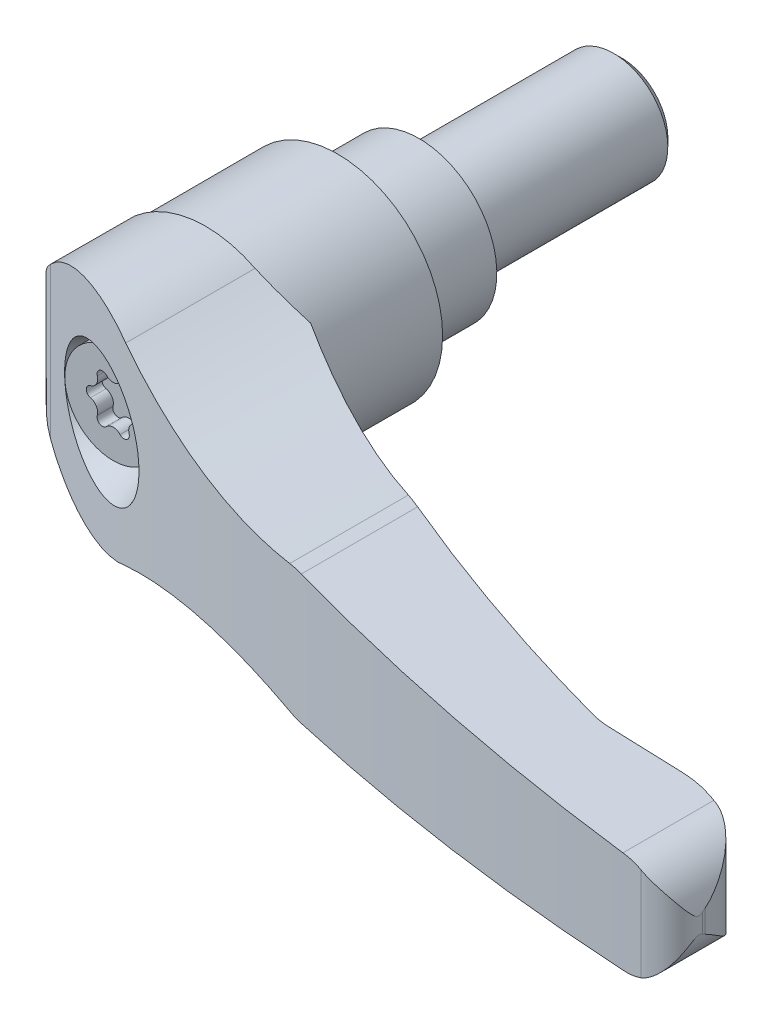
ISO-10303-21;
HEADER;
FILE_DESCRIPTION(('STEP AP214'),'2;1');
FILE_NAME('part.step','',(''),(''),'','','');
FILE_SCHEMA(('AUTOMOTIVE_DESIGN { 1 0 10303 214 1 1 1 1 }'));
ENDSEC;
DATA;
#1=APPLICATION_CONTEXT('core data for automotive mechanical design processes');
#2=APPLICATION_PROTOCOL_DEFINITION('international standard','automotive_design',2000,#1);
#3=PRODUCT_CONTEXT('',#1,'mechanical');
#4=PRODUCT('Part','Part','',(#3));
#5=PRODUCT_RELATED_PRODUCT_CATEGORY('part','',(#4));
#6=PRODUCT_DEFINITION_FORMATION('','',#4);
#7=PRODUCT_DEFINITION_CONTEXT('part definition',#1,'design');
#8=PRODUCT_DEFINITION('design','',#6,#7);
#9=PRODUCT_DEFINITION_SHAPE('','',#8);
#10=(LENGTH_UNIT() NAMED_UNIT(*) SI_UNIT(.MILLI.,.METRE.));
#11=(NAMED_UNIT(*) PLANE_ANGLE_UNIT() SI_UNIT($,.RADIAN.));
#12=(NAMED_UNIT(*) SI_UNIT($,.STERADIAN.) SOLID_ANGLE_UNIT());
#13=UNCERTAINTY_MEASURE_WITH_UNIT(LENGTH_MEASURE(1.E-05),#10,'distance_accuracy_value','');
#14=(GEOMETRIC_REPRESENTATION_CONTEXT(3) GLOBAL_UNCERTAINTY_ASSIGNED_CONTEXT((#13)) GLOBAL_UNIT_ASSIGNED_CONTEXT((#10,
#11,#12)) REPRESENTATION_CONTEXT('',''));
#15=CARTESIAN_POINT('',(0.,0.,0.));
#16=DIRECTION('',(0.,0.,1.));
#17=DIRECTION('',(1.,0.,0.));
#18=AXIS2_PLACEMENT_3D('',#15,#16,#17);
#19=CARTESIAN_POINT('',(6.77133,0.,-30.));
#20=DIRECTION('',(0.,0.,-1.));
#21=DIRECTION('',(0.,1.,0.));
#22=AXIS2_PLACEMENT_3D('',#19,#20,#21);
#23=PLANE('',#22);
#24=CARTESIAN_POINT('',(0.,0.,-30.));
#25=DIRECTION('',(0.,0.,1.));
#26=DIRECTION('',(0.,-1.,0.));
#27=AXIS2_PLACEMENT_3D('',#24,#25,#26);
#28=CIRCLE('',#27,6.77133);
#29=CARTESIAN_POINT('',(0.,-6.77133,-30.));
#30=VERTEX_POINT('',#29);
#31=EDGE_CURVE('E1243',#30,#30,#28,.T.);
#32=ORIENTED_EDGE('',*,*,#31,.F.);
#33=EDGE_LOOP('',(#32));
#34=FACE_BOUND('',#33,.T.);
#35=ADVANCED_FACE('F14',(#34),#23,.T.);
#36=CARTESIAN_POINT('',(0.,0.,-28.77133));
#37=DIRECTION('',(0.,0.,1.));
#38=DIRECTION('',(0.,-1.,0.));
#39=AXIS2_PLACEMENT_3D('',#36,#37,#38);
#40=CONICAL_SURFACE('',#39,8.,0.785398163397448);
#41=ORIENTED_EDGE('',*,*,#31,.T.);
#42=EDGE_LOOP('',(#41));
#43=FACE_BOUND('',#42,.T.);
#44=CARTESIAN_POINT('',(0.,0.,-28.77133));
#45=DIRECTION('',(0.,0.,1.));
#46=DIRECTION('',(0.,-1.,0.));
#47=AXIS2_PLACEMENT_3D('',#44,#45,#46);
#48=CIRCLE('',#47,8.);
#49=CARTESIAN_POINT('',(0.,-8.,-28.77133));
#50=VERTEX_POINT('',#49);
#51=EDGE_CURVE('E1246',#50,#50,#48,.T.);
#52=ORIENTED_EDGE('',*,*,#51,.F.);
#53=EDGE_LOOP('',(#52));
#54=FACE_BOUND('',#53,.T.);
#55=ADVANCED_FACE('F896',(#43,#54),#40,.T.);
#56=CARTESIAN_POINT('',(0.,0.,12.));
#57=DIRECTION('',(0.,0.,1.));
#58=DIRECTION('',(0.,-1.,0.));
#59=AXIS2_PLACEMENT_3D('',#56,#57,#58);
#60=CYLINDRICAL_SURFACE('',#59,8.);
#61=ORIENTED_EDGE('',*,*,#51,.T.);
#62=EDGE_LOOP('',(#61));
#63=FACE_BOUND('',#62,.T.);
#64=CARTESIAN_POINT('',(0.,0.,0.));
#65=DIRECTION('',(0.,0.,1.));
#66=DIRECTION('',(0.,-1.,0.));
#67=AXIS2_PLACEMENT_3D('',#64,#65,#66);
#68=CIRCLE('',#67,8.);
#69=CARTESIAN_POINT('',(0.,-8.,0.));
#70=VERTEX_POINT('',#69);
#71=EDGE_CURVE('E1254',#70,#70,#68,.T.);
#72=ORIENTED_EDGE('',*,*,#71,.F.);
#73=EDGE_LOOP('',(#72));
#74=FACE_BOUND('',#73,.T.);
#75=ADVANCED_FACE('F907',(#63,#74),#60,.T.);
#76=CARTESIAN_POINT('',(11.5,0.,0.));
#77=DIRECTION('',(0.,0.,-1.));
#78=DIRECTION('',(0.,1.,0.));
#79=AXIS2_PLACEMENT_3D('',#76,#77,#78);
#80=PLANE('',#79);
#81=ORIENTED_EDGE('',*,*,#71,.T.);
#82=EDGE_LOOP('',(#81));
#83=FACE_BOUND('',#82,.T.);
#84=CARTESIAN_POINT('',(0.,0.,0.));
#85=DIRECTION('',(0.,0.,1.));
#86=DIRECTION('',(0.,-1.,0.));
#87=AXIS2_PLACEMENT_3D('',#84,#85,#86);
#88=CIRCLE('',#87,11.5);
#89=CARTESIAN_POINT('',(0.,-11.5,0.));
#90=VERTEX_POINT('',#89);
#91=EDGE_CURVE('E1257',#90,#90,#88,.T.);
#92=ORIENTED_EDGE('',*,*,#91,.F.);
#93=EDGE_LOOP('',(#92));
#94=FACE_BOUND('',#93,.T.);
#95=ADVANCED_FACE('F918',(#83,#94),#80,.T.);
#96=CARTESIAN_POINT('',(0.,0.,12.));
#97=DIRECTION('',(0.,0.,1.));
#98=DIRECTION('',(0.,-1.,0.));
#99=AXIS2_PLACEMENT_3D('',#96,#97,#98);
#100=CYLINDRICAL_SURFACE('',#99,11.5);
#101=ORIENTED_EDGE('',*,*,#91,.T.);
#102=EDGE_LOOP('',(#101));
#103=FACE_BOUND('',#102,.T.);
#104=CARTESIAN_POINT('',(0.,0.,12.75));
#105=DIRECTION('',(0.,0.,1.));
#106=DIRECTION('',(0.,-1.,0.));
#107=AXIS2_PLACEMENT_3D('',#104,#105,#106);
#108=CIRCLE('',#107,11.5);
#109=CARTESIAN_POINT('',(0.,-11.5,12.75));
#110=VERTEX_POINT('',#109);
#111=EDGE_CURVE('E590',#110,#110,#108,.T.);
#112=ORIENTED_EDGE('',*,*,#111,.F.);
#113=EDGE_LOOP('',(#112));
#114=FACE_BOUND('',#113,.T.);
#115=ADVANCED_FACE('F562',(#103,#114),#100,.T.);
#116=CARTESIAN_POINT('',(7.15,0.,42.87));
#117=DIRECTION('',(0.,0.,-1.));
#118=DIRECTION('',(0.,1.,0.));
#119=AXIS2_PLACEMENT_3D('',#116,#117,#118);
#120=PLANE('',#119);
#121=CARTESIAN_POINT('',(1.59,2.75396078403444,42.87));
#122=DIRECTION('',(0.,0.,-1.));
#123=DIRECTION('',(0.,1.,0.));
#124=AXIS2_PLACEMENT_3D('',#121,#122,#123);
#125=CIRCLE('',#124,0.795000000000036);
#126=CARTESIAN_POINT('',(2.3516351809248,2.5260642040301,42.87));
#127=VERTEX_POINT('',#126);
#128=CARTESIAN_POINT('',(1.0118181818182,3.2996079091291,42.87));
#129=VERTEX_POINT('',#128);
#130=EDGE_CURVE('E1312',#127,#129,#125,.F.);
#131=ORIENTED_EDGE('',*,*,#130,.T.);
#132=CARTESIAN_POINT('',(0.,4.25449037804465,42.87));
#133=DIRECTION('',(0.,0.,-1.));
#134=DIRECTION('',(0.,1.,0.));
#135=AXIS2_PLACEMENT_3D('',#132,#133,#134);
#136=CIRCLE('',#135,1.39125000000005);
#137=CARTESIAN_POINT('',(-1.0118181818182,3.2996079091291,42.87));
#138=VERTEX_POINT('',#137);
#139=EDGE_CURVE('E1333',#138,#129,#136,.F.);
#140=ORIENTED_EDGE('',*,*,#139,.F.);
#141=CARTESIAN_POINT('',(-1.58999999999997,2.75396078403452,42.87));
#142=DIRECTION('',(0.,0.,-1.));
#143=DIRECTION('',(0.,1.,0.));
#144=AXIS2_PLACEMENT_3D('',#141,#142,#143);
#145=CIRCLE('',#144,0.794999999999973);
#146=CARTESIAN_POINT('',(-2.3516351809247,2.5260642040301,42.87));
#147=VERTEX_POINT('',#146);
#148=EDGE_CURVE('E1308',#138,#147,#145,.F.);
#149=ORIENTED_EDGE('',*,*,#148,.T.);
#150=CARTESIAN_POINT('',(-3.68449674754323,2.12724518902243,42.87));
#151=DIRECTION('',(0.,0.,-1.));
#152=DIRECTION('',(0.,1.,0.));
#153=AXIS2_PLACEMENT_3D('',#150,#151,#152);
#154=CIRCLE('',#153,1.39125000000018);
#155=CARTESIAN_POINT('',(-3.3634533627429,0.77354370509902,42.87));
#156=VERTEX_POINT('',#155);
#157=EDGE_CURVE('E1330',#156,#147,#154,.F.);
#158=ORIENTED_EDGE('',*,*,#157,.F.);
#159=CARTESIAN_POINT('',(-3.18,0.,42.87));
#160=DIRECTION('',(0.,0.,-1.));
#161=DIRECTION('',(0.,1.,0.));
#162=AXIS2_PLACEMENT_3D('',#159,#160,#161);
#163=CIRCLE('',#162,0.795);
#164=CARTESIAN_POINT('',(-3.3634533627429,-0.77354370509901,42.87));
#165=VERTEX_POINT('',#164);
#166=EDGE_CURVE('E110',#156,#165,#163,.F.);
#167=ORIENTED_EDGE('',*,*,#166,.T.);
#168=CARTESIAN_POINT('',(-3.68449674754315,-2.12724518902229,42.87));
#169=DIRECTION('',(0.,0.,-1.));
#170=DIRECTION('',(0.,1.,0.));
#171=AXIS2_PLACEMENT_3D('',#168,#169,#170);
#172=CIRCLE('',#171,1.39125000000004);
#173=CARTESIAN_POINT('',(-2.3516351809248,-2.5260642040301,42.87));
#174=VERTEX_POINT('',#173);
#175=EDGE_CURVE('E1326',#174,#165,#172,.F.);
#176=ORIENTED_EDGE('',*,*,#175,.F.);
#177=CARTESIAN_POINT('',(-1.59,-2.75396078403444,42.87));
#178=DIRECTION('',(0.,0.,-1.));
#179=DIRECTION('',(0.,1.,0.));
#180=AXIS2_PLACEMENT_3D('',#177,#178,#179);
#181=CIRCLE('',#180,0.795000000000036);
#182=CARTESIAN_POINT('',(-1.0118181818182,-3.2996079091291,42.87));
#183=VERTEX_POINT('',#182);
#184=EDGE_CURVE('E1324',#174,#183,#181,.F.);
#185=ORIENTED_EDGE('',*,*,#184,.T.);
#186=CARTESIAN_POINT('',(0.,-4.25449037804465,42.87));
#187=DIRECTION('',(0.,0.,-1.));
#188=DIRECTION('',(0.,1.,0.));
#189=AXIS2_PLACEMENT_3D('',#186,#187,#188);
#190=CIRCLE('',#189,1.39125000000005);
#191=CARTESIAN_POINT('',(1.0118181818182,-3.2996079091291,42.87));
#192=VERTEX_POINT('',#191);
#193=EDGE_CURVE('E1325',#192,#183,#190,.F.);
#194=ORIENTED_EDGE('',*,*,#193,.F.);
#195=CARTESIAN_POINT('',(1.58999999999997,-2.75396078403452,42.87));
#196=DIRECTION('',(0.,0.,-1.));
#197=DIRECTION('',(0.,1.,0.));
#198=AXIS2_PLACEMENT_3D('',#195,#196,#197);
#199=CIRCLE('',#198,0.794999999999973);
#200=CARTESIAN_POINT('',(2.3516351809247,-2.5260642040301,42.87));
#201=VERTEX_POINT('',#200);
#202=EDGE_CURVE('E1293',#192,#201,#199,.F.);
#203=ORIENTED_EDGE('',*,*,#202,.T.);
#204=CARTESIAN_POINT('',(3.68449674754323,-2.12724518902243,42.87));
#205=DIRECTION('',(0.,0.,-1.));
#206=DIRECTION('',(0.,1.,0.));
#207=AXIS2_PLACEMENT_3D('',#204,#205,#206);
#208=CIRCLE('',#207,1.39125000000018);
#209=CARTESIAN_POINT('',(3.3634533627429,-0.77354370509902,42.87));
#210=VERTEX_POINT('',#209);
#211=EDGE_CURVE('E1328',#210,#201,#208,.F.);
#212=ORIENTED_EDGE('',*,*,#211,.F.);
#213=CARTESIAN_POINT('',(3.18,0.,42.87));
#214=DIRECTION('',(0.,0.,-1.));
#215=DIRECTION('',(0.,1.,0.));
#216=AXIS2_PLACEMENT_3D('',#213,#214,#215);
#217=CIRCLE('',#216,0.795);
#218=CARTESIAN_POINT('',(3.3634533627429,0.77354370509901,42.87));
#219=VERTEX_POINT('',#218);
#220=EDGE_CURVE('E1317',#210,#219,#217,.F.);
#221=ORIENTED_EDGE('',*,*,#220,.T.);
#222=CARTESIAN_POINT('',(3.68449674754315,2.12724518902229,42.87));
#223=DIRECTION('',(0.,0.,-1.));
#224=DIRECTION('',(0.,1.,0.));
#225=AXIS2_PLACEMENT_3D('',#222,#223,#224);
#226=CIRCLE('',#225,1.39125000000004);
#227=EDGE_CURVE('E1339',#127,#219,#226,.F.);
#228=ORIENTED_EDGE('',*,*,#227,.F.);
#229=EDGE_LOOP('',(#131,#140,#149,#158,#167,#176,#185,#194,#203,#212,#221,#228));
#230=FACE_BOUND('',#229,.T.);
#231=ADVANCED_FACE('F939',(#230),#120,.F.);
#232=CARTESIAN_POINT('',(-3.68449674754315,-2.12724518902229,49.24));
#233=DIRECTION('',(0.,0.,-1.));
#234=DIRECTION('',(0.,1.,0.));
#235=AXIS2_PLACEMENT_3D('',#232,#233,#234);
#236=CYLINDRICAL_SURFACE('',#235,1.39125000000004);
#237=DIRECTION('',(0.,0.,-1.));
#238=VECTOR('',#237,1.);
#239=CARTESIAN_POINT('',(-2.3516351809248,-2.5260642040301,49.24));
#240=LINE('',#239,#238);
#241=CARTESIAN_POINT('',(-2.3516351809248,-2.5260642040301,45.19));
#242=VERTEX_POINT('',#241);
#243=EDGE_CURVE('E1296',#242,#174,#240,.T.);
#244=ORIENTED_EDGE('',*,*,#243,.T.);
#245=ORIENTED_EDGE('',*,*,#175,.T.);
#246=DIRECTION('',(0.,0.,-1.));
#247=VECTOR('',#246,1.);
#248=CARTESIAN_POINT('',(-3.3634533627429,-0.77354370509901,49.24));
#249=LINE('',#248,#247);
#250=CARTESIAN_POINT('',(-3.3634533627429,-0.77354370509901,45.19));
#251=VERTEX_POINT('',#250);
#252=EDGE_CURVE('E1304',#251,#165,#249,.T.);
#253=ORIENTED_EDGE('',*,*,#252,.F.);
#254=CARTESIAN_POINT('',(-3.68449674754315,-2.12724518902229,45.19));
#255=DIRECTION('',(0.,0.,1.));
#256=DIRECTION('',(0.,-1.,0.));
#257=AXIS2_PLACEMENT_3D('',#254,#255,#256);
#258=CIRCLE('',#257,1.39125000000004);
#259=EDGE_CURVE('E1241',#242,#251,#258,.T.);
#260=ORIENTED_EDGE('',*,*,#259,.F.);
#261=EDGE_LOOP('',(#244,#245,#253,#260));
#262=FACE_BOUND('',#261,.T.);
#263=ADVANCED_FACE('F950',(#262),#236,.T.);
#264=CARTESIAN_POINT('',(-1.59,-2.75396078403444,49.24));
#265=DIRECTION('',(0.,0.,-1.));
#266=DIRECTION('',(0.,1.,0.));
#267=AXIS2_PLACEMENT_3D('',#264,#265,#266);
#268=CYLINDRICAL_SURFACE('',#267,0.795000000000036);
#269=DIRECTION('',(0.,0.,-1.));
#270=VECTOR('',#269,1.);
#271=CARTESIAN_POINT('',(-1.0118181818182,-3.2996079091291,49.24));
#272=LINE('',#271,#270);
#273=CARTESIAN_POINT('',(-1.0118181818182,-3.2996079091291,45.19));
#274=VERTEX_POINT('',#273);
#275=EDGE_CURVE('E1290',#274,#183,#272,.T.);
#276=ORIENTED_EDGE('',*,*,#275,.T.);
#277=ORIENTED_EDGE('',*,*,#184,.F.);
#278=ORIENTED_EDGE('',*,*,#243,.F.);
#279=CARTESIAN_POINT('',(-1.59,-2.75396078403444,45.19));
#280=DIRECTION('',(0.,0.,1.));
#281=DIRECTION('',(0.,-1.,0.));
#282=AXIS2_PLACEMENT_3D('',#279,#280,#281);
#283=CIRCLE('',#282,0.795000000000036);
#284=EDGE_CURVE('E1248',#274,#242,#283,.F.);
#285=ORIENTED_EDGE('',*,*,#284,.F.);
#286=EDGE_LOOP('',(#276,#277,#278,#285));
#287=FACE_BOUND('',#286,.T.);
#288=ADVANCED_FACE('F960',(#287),#268,.F.);
#289=CARTESIAN_POINT('',(0.,-4.25449037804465,49.24));
#290=DIRECTION('',(0.,0.,-1.));
#291=DIRECTION('',(0.,1.,0.));
#292=AXIS2_PLACEMENT_3D('',#289,#290,#291);
#293=CYLINDRICAL_SURFACE('',#292,1.39125000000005);
#294=DIRECTION('',(0.,0.,-1.));
#295=VECTOR('',#294,1.);
#296=CARTESIAN_POINT('',(1.0118181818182,-3.2996079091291,49.24));
#297=LINE('',#296,#295);
#298=CARTESIAN_POINT('',(1.0118181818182,-3.2996079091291,45.19));
#299=VERTEX_POINT('',#298);
#300=EDGE_CURVE('E1287',#299,#192,#297,.T.);
#301=ORIENTED_EDGE('',*,*,#300,.T.);
#302=ORIENTED_EDGE('',*,*,#193,.T.);
#303=ORIENTED_EDGE('',*,*,#275,.F.);
#304=CARTESIAN_POINT('',(0.,-4.25449037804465,45.19));
#305=DIRECTION('',(0.,0.,1.));
#306=DIRECTION('',(0.,-1.,0.));
#307=AXIS2_PLACEMENT_3D('',#304,#305,#306);
#308=CIRCLE('',#307,1.39125000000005);
#309=EDGE_CURVE('E1270',#299,#274,#308,.T.);
#310=ORIENTED_EDGE('',*,*,#309,.F.);
#311=EDGE_LOOP('',(#301,#302,#303,#310));
#312=FACE_BOUND('',#311,.T.);
#313=ADVANCED_FACE('F972',(#312),#293,.T.);
#314=CARTESIAN_POINT('',(1.58999999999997,-2.75396078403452,49.24));
#315=DIRECTION('',(0.,0.,-1.));
#316=DIRECTION('',(0.,1.,0.));
#317=AXIS2_PLACEMENT_3D('',#314,#315,#316);
#318=CYLINDRICAL_SURFACE('',#317,0.794999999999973);
#319=DIRECTION('',(0.,0.,-1.));
#320=VECTOR('',#319,1.);
#321=CARTESIAN_POINT('',(2.3516351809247,-2.5260642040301,49.24));
#322=LINE('',#321,#320);
#323=CARTESIAN_POINT('',(2.3516351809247,-2.5260642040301,45.19));
#324=VERTEX_POINT('',#323);
#325=EDGE_CURVE('E1294',#324,#201,#322,.T.);
#326=ORIENTED_EDGE('',*,*,#325,.T.);
#327=ORIENTED_EDGE('',*,*,#202,.F.);
#328=ORIENTED_EDGE('',*,*,#300,.F.);
#329=CARTESIAN_POINT('',(1.58999999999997,-2.75396078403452,45.19));
#330=DIRECTION('',(0.,0.,1.));
#331=DIRECTION('',(0.,-1.,0.));
#332=AXIS2_PLACEMENT_3D('',#329,#330,#331);
#333=CIRCLE('',#332,0.794999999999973);
#334=EDGE_CURVE('E1282',#324,#299,#333,.F.);
#335=ORIENTED_EDGE('',*,*,#334,.F.);
#336=EDGE_LOOP('',(#326,#327,#328,#335));
#337=FACE_BOUND('',#336,.T.);
#338=ADVANCED_FACE('F983',(#337),#318,.F.);
#339=CARTESIAN_POINT('',(3.68449674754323,-2.12724518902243,49.24));
#340=DIRECTION('',(0.,0.,-1.));
#341=DIRECTION('',(0.,1.,0.));
#342=AXIS2_PLACEMENT_3D('',#339,#340,#341);
#343=CYLINDRICAL_SURFACE('',#342,1.39125000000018);
#344=DIRECTION('',(0.,0.,-1.));
#345=VECTOR('',#344,1.);
#346=CARTESIAN_POINT('',(3.3634533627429,-0.77354370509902,49.24));
#347=LINE('',#346,#345);
#348=CARTESIAN_POINT('',(3.3634533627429,-0.77354370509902,45.19));
#349=VERTEX_POINT('',#348);
#350=EDGE_CURVE('E1298',#349,#210,#347,.T.);
#351=ORIENTED_EDGE('',*,*,#350,.T.);
#352=ORIENTED_EDGE('',*,*,#211,.T.);
#353=ORIENTED_EDGE('',*,*,#325,.F.);
#354=CARTESIAN_POINT('',(3.68449674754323,-2.12724518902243,45.19));
#355=DIRECTION('',(0.,0.,1.));
#356=DIRECTION('',(0.,-1.,0.));
#357=AXIS2_PLACEMENT_3D('',#354,#355,#356);
#358=CIRCLE('',#357,1.39125000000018);
#359=EDGE_CURVE('E1267',#349,#324,#358,.T.);
#360=ORIENTED_EDGE('',*,*,#359,.F.);
#361=EDGE_LOOP('',(#351,#352,#353,#360));
#362=FACE_BOUND('',#361,.T.);
#363=ADVANCED_FACE('F994',(#362),#343,.T.);
#364=CARTESIAN_POINT('',(3.18,0.,49.24));
#365=DIRECTION('',(0.,0.,-1.));
#366=DIRECTION('',(0.,1.,0.));
#367=AXIS2_PLACEMENT_3D('',#364,#365,#366);
#368=CYLINDRICAL_SURFACE('',#367,0.795);
#369=DIRECTION('',(0.,0.,-1.));
#370=VECTOR('',#369,1.);
#371=CARTESIAN_POINT('',(3.3634533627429,0.77354370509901,49.24));
#372=LINE('',#371,#370);
#373=CARTESIAN_POINT('',(3.3634533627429,0.77354370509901,45.19));
#374=VERTEX_POINT('',#373);
#375=EDGE_CURVE('E1354',#374,#219,#372,.T.);
#376=ORIENTED_EDGE('',*,*,#375,.T.);
#377=ORIENTED_EDGE('',*,*,#220,.F.);
#378=ORIENTED_EDGE('',*,*,#350,.F.);
#379=CARTESIAN_POINT('',(3.18,0.,45.19));
#380=DIRECTION('',(0.,0.,1.));
#381=DIRECTION('',(0.,-1.,0.));
#382=AXIS2_PLACEMENT_3D('',#379,#380,#381);
#383=CIRCLE('',#382,0.795);
#384=EDGE_CURVE('E1319',#374,#349,#383,.F.);
#385=ORIENTED_EDGE('',*,*,#384,.F.);
#386=EDGE_LOOP('',(#376,#377,#378,#385));
#387=FACE_BOUND('',#386,.T.);
#388=ADVANCED_FACE('F1005',(#387),#368,.F.);
#389=CARTESIAN_POINT('',(3.68449674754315,2.12724518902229,49.24));
#390=DIRECTION('',(0.,0.,-1.));
#391=DIRECTION('',(0.,1.,0.));
#392=AXIS2_PLACEMENT_3D('',#389,#390,#391);
#393=CYLINDRICAL_SURFACE('',#392,1.39125000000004);
#394=DIRECTION('',(0.,0.,-1.));
#395=VECTOR('',#394,1.);
#396=CARTESIAN_POINT('',(2.3516351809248,2.5260642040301,49.24));
#397=LINE('',#396,#395);
#398=CARTESIAN_POINT('',(2.3516351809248,2.5260642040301,45.19));
#399=VERTEX_POINT('',#398);
#400=EDGE_CURVE('E1351',#399,#127,#397,.T.);
#401=ORIENTED_EDGE('',*,*,#400,.T.);
#402=ORIENTED_EDGE('',*,*,#227,.T.);
#403=ORIENTED_EDGE('',*,*,#375,.F.);
#404=CARTESIAN_POINT('',(3.68449674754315,2.12724518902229,45.19));
#405=DIRECTION('',(0.,0.,1.));
#406=DIRECTION('',(0.,-1.,0.));
#407=AXIS2_PLACEMENT_3D('',#404,#405,#406);
#408=CIRCLE('',#407,1.39125000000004);
#409=EDGE_CURVE('E1264',#399,#374,#408,.T.);
#410=ORIENTED_EDGE('',*,*,#409,.F.);
#411=EDGE_LOOP('',(#401,#402,#403,#410));
#412=FACE_BOUND('',#411,.T.);
#413=ADVANCED_FACE('F1016',(#412),#393,.T.);
#414=CARTESIAN_POINT('',(1.59,2.75396078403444,49.24));
#415=DIRECTION('',(0.,0.,-1.));
#416=DIRECTION('',(0.,1.,0.));
#417=AXIS2_PLACEMENT_3D('',#414,#415,#416);
#418=CYLINDRICAL_SURFACE('',#417,0.795000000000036);
#419=ORIENTED_EDGE('',*,*,#130,.F.);
#420=ORIENTED_EDGE('',*,*,#400,.F.);
#421=CARTESIAN_POINT('',(1.59,2.75396078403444,45.19));
#422=DIRECTION('',(0.,0.,1.));
#423=DIRECTION('',(0.,-1.,0.));
#424=AXIS2_PLACEMENT_3D('',#421,#422,#423);
#425=CIRCLE('',#424,0.795000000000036);
#426=CARTESIAN_POINT('',(1.0118181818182,3.2996079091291,45.19));
#427=VERTEX_POINT('',#426);
#428=EDGE_CURVE('E1314',#427,#399,#425,.F.);
#429=ORIENTED_EDGE('',*,*,#428,.F.);
#430=DIRECTION('',(0.,0.,-1.));
#431=VECTOR('',#430,1.);
#432=CARTESIAN_POINT('',(1.0118181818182,3.2996079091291,49.24));
#433=LINE('',#432,#431);
#434=EDGE_CURVE('E1348',#427,#129,#433,.T.);
#435=ORIENTED_EDGE('',*,*,#434,.T.);
#436=EDGE_LOOP('',(#419,#420,#429,#435));
#437=FACE_BOUND('',#436,.T.);
#438=ADVANCED_FACE('F1027',(#437),#418,.F.);
#439=CARTESIAN_POINT('',(0.,4.25449037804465,49.24));
#440=DIRECTION('',(0.,0.,-1.));
#441=DIRECTION('',(0.,1.,0.));
#442=AXIS2_PLACEMENT_3D('',#439,#440,#441);
#443=CYLINDRICAL_SURFACE('',#442,1.39125000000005);
#444=DIRECTION('',(0.,0.,-1.));
#445=VECTOR('',#444,1.);
#446=CARTESIAN_POINT('',(-1.0118181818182,3.2996079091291,49.24));
#447=LINE('',#446,#445);
#448=CARTESIAN_POINT('',(-1.0118181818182,3.2996079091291,45.19));
#449=VERTEX_POINT('',#448);
#450=EDGE_CURVE('E1345',#449,#138,#447,.T.);
#451=ORIENTED_EDGE('',*,*,#450,.T.);
#452=ORIENTED_EDGE('',*,*,#139,.T.);
#453=ORIENTED_EDGE('',*,*,#434,.F.);
#454=CARTESIAN_POINT('',(0.,4.25449037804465,45.19));
#455=DIRECTION('',(0.,0.,1.));
#456=DIRECTION('',(0.,-1.,0.));
#457=AXIS2_PLACEMENT_3D('',#454,#455,#456);
#458=CIRCLE('',#457,1.39125000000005);
#459=EDGE_CURVE('E1261',#449,#427,#458,.T.);
#460=ORIENTED_EDGE('',*,*,#459,.F.);
#461=EDGE_LOOP('',(#451,#452,#453,#460));
#462=FACE_BOUND('',#461,.T.);
#463=ADVANCED_FACE('F1038',(#462),#443,.T.);
#464=CARTESIAN_POINT('',(-1.58999999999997,2.75396078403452,49.24));
#465=DIRECTION('',(0.,0.,-1.));
#466=DIRECTION('',(0.,1.,0.));
#467=AXIS2_PLACEMENT_3D('',#464,#465,#466);
#468=CYLINDRICAL_SURFACE('',#467,0.794999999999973);
#469=ORIENTED_EDGE('',*,*,#148,.F.);
#470=ORIENTED_EDGE('',*,*,#450,.F.);
#471=CARTESIAN_POINT('',(-1.58999999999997,2.75396078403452,45.19));
#472=DIRECTION('',(0.,0.,1.));
#473=DIRECTION('',(0.,-1.,0.));
#474=AXIS2_PLACEMENT_3D('',#471,#472,#473);
#475=CIRCLE('',#474,0.794999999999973);
#476=CARTESIAN_POINT('',(-2.3516351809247,2.5260642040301,45.19));
#477=VERTEX_POINT('',#476);
#478=EDGE_CURVE('E1310',#477,#449,#475,.F.);
#479=ORIENTED_EDGE('',*,*,#478,.F.);
#480=DIRECTION('',(0.,0.,-1.));
#481=VECTOR('',#480,1.);
#482=CARTESIAN_POINT('',(-2.3516351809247,2.5260642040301,49.24));
#483=LINE('',#482,#481);
#484=EDGE_CURVE('E1342',#477,#147,#483,.T.);
#485=ORIENTED_EDGE('',*,*,#484,.T.);
#486=EDGE_LOOP('',(#469,#470,#479,#485));
#487=FACE_BOUND('',#486,.T.);
#488=ADVANCED_FACE('F1049',(#487),#468,.F.);
#489=CARTESIAN_POINT('',(-3.68449674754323,2.12724518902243,49.24));
#490=DIRECTION('',(0.,0.,-1.));
#491=DIRECTION('',(0.,1.,0.));
#492=AXIS2_PLACEMENT_3D('',#489,#490,#491);
#493=CYLINDRICAL_SURFACE('',#492,1.39125000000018);
#494=DIRECTION('',(0.,0.,-1.));
#495=VECTOR('',#494,1.);
#496=CARTESIAN_POINT('',(-3.3634533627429,0.77354370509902,49.24));
#497=LINE('',#496,#495);
#498=CARTESIAN_POINT('',(-3.3634533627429,0.77354370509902,45.19));
#499=VERTEX_POINT('',#498);
#500=EDGE_CURVE('E1306',#499,#156,#497,.T.);
#501=ORIENTED_EDGE('',*,*,#500,.T.);
#502=ORIENTED_EDGE('',*,*,#157,.T.);
#503=ORIENTED_EDGE('',*,*,#484,.F.);
#504=CARTESIAN_POINT('',(-3.68449674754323,2.12724518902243,45.19));
#505=DIRECTION('',(0.,0.,1.));
#506=DIRECTION('',(0.,-1.,0.));
#507=AXIS2_PLACEMENT_3D('',#504,#505,#506);
#508=CIRCLE('',#507,1.39125000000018);
#509=EDGE_CURVE('E18',#499,#477,#508,.T.);
#510=ORIENTED_EDGE('',*,*,#509,.F.);
#511=EDGE_LOOP('',(#501,#502,#503,#510));
#512=FACE_BOUND('',#511,.T.);
#513=ADVANCED_FACE('F952',(#512),#493,.T.);
#514=CARTESIAN_POINT('',(-3.18,0.,49.24));
#515=DIRECTION('',(0.,0.,-1.));
#516=DIRECTION('',(0.,1.,0.));
#517=AXIS2_PLACEMENT_3D('',#514,#515,#516);
#518=CYLINDRICAL_SURFACE('',#517,0.795);
#519=ORIENTED_EDGE('',*,*,#252,.T.);
#520=ORIENTED_EDGE('',*,*,#166,.F.);
#521=ORIENTED_EDGE('',*,*,#500,.F.);
#522=CARTESIAN_POINT('',(-3.18,0.,45.19));
#523=DIRECTION('',(0.,0.,1.));
#524=DIRECTION('',(0.,-1.,0.));
#525=AXIS2_PLACEMENT_3D('',#522,#523,#524);
#526=CIRCLE('',#525,0.795);
#527=EDGE_CURVE('E1238',#251,#499,#526,.F.);
#528=ORIENTED_EDGE('',*,*,#527,.F.);
#529=EDGE_LOOP('',(#519,#520,#521,#528));
#530=FACE_BOUND('',#529,.T.);
#531=ADVANCED_FACE('F963',(#530),#518,.F.);
#532=CARTESIAN_POINT('',(0.,0.,45.19));
#533=DIRECTION('',(0.,0.,1.));
#534=DIRECTION('',(0.,-1.,0.));
#535=AXIS2_PLACEMENT_3D('',#532,#533,#534);
#536=PLANE('',#535);
#537=CARTESIAN_POINT('',(0.,0.,45.19));
#538=DIRECTION('',(0.,0.,1.));
#539=DIRECTION('',(0.,-1.,0.));
#540=AXIS2_PLACEMENT_3D('',#537,#538,#539);
#541=CIRCLE('',#540,7.15);
#542=CARTESIAN_POINT('',(0.,-7.15,45.19));
#543=VERTEX_POINT('',#542);
#544=EDGE_CURVE('E1234',#543,#543,#541,.T.);
#545=ORIENTED_EDGE('',*,*,#544,.T.);
#546=EDGE_LOOP('',(#545));
#547=FACE_BOUND('',#546,.T.);
#548=ORIENTED_EDGE('',*,*,#527,.T.);
#549=ORIENTED_EDGE('',*,*,#509,.T.);
#550=ORIENTED_EDGE('',*,*,#478,.T.);
#551=ORIENTED_EDGE('',*,*,#459,.T.);
#552=ORIENTED_EDGE('',*,*,#428,.T.);
#553=ORIENTED_EDGE('',*,*,#409,.T.);
#554=ORIENTED_EDGE('',*,*,#384,.T.);
#555=ORIENTED_EDGE('',*,*,#359,.T.);
#556=ORIENTED_EDGE('',*,*,#334,.T.);
#557=ORIENTED_EDGE('',*,*,#309,.T.);
#558=ORIENTED_EDGE('',*,*,#284,.T.);
#559=ORIENTED_EDGE('',*,*,#259,.T.);
#560=EDGE_LOOP('',(#548,#549,#550,#551,#552,#553,#554,#555,#556,#557,#558,#559));
#561=FACE_BOUND('',#560,.T.);
#562=ADVANCED_FACE('F16',(#547,#561),#536,.T.);
#563=CARTESIAN_POINT('',(0.,0.,12.));
#564=DIRECTION('',(0.,0.,1.));
#565=DIRECTION('',(0.,-1.,0.));
#566=AXIS2_PLACEMENT_3D('',#563,#564,#565);
#567=CYLINDRICAL_SURFACE('',#566,7.15);
#568=CARTESIAN_POINT('',(0.,0.,42.87));
#569=DIRECTION('',(0.,0.,1.));
#570=DIRECTION('',(0.,-1.,0.));
#571=AXIS2_PLACEMENT_3D('',#568,#569,#570);
#572=CIRCLE('',#571,7.15);
#573=CARTESIAN_POINT('',(0.,-7.15,42.87));
#574=VERTEX_POINT('',#573);
#575=EDGE_CURVE('E585',#574,#574,#572,.T.);
#576=ORIENTED_EDGE('',*,*,#575,.T.);
#577=EDGE_LOOP('',(#576));
#578=FACE_BOUND('',#577,.T.);
#579=ORIENTED_EDGE('',*,*,#544,.F.);
#580=EDGE_LOOP('',(#579));
#581=FACE_BOUND('',#580,.T.);
#582=ADVANCED_FACE('F554',(#578,#581),#567,.T.);
#583=CARTESIAN_POINT('',(-15.51,-17.,31.5));
#584=DIRECTION('',(0.,0.,1.));
#585=DIRECTION('',(0.,-1.,0.));
#586=AXIS2_PLACEMENT_3D('',#583,#584,#585);
#587=PLANE('',#586);
#588=CARTESIAN_POINT('',(33.7499999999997,-76.32,31.5));
#589=DIRECTION('',(0.,0.,1.));
#590=DIRECTION('',(0.,-1.,0.));
#591=AXIS2_PLACEMENT_3D('',#588,#589,#590);
#592=CIRCLE('',#591,67.48);
#593=CARTESIAN_POINT('',(7.274193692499,-14.250828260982,31.5));
#594=VERTEX_POINT('',#593);
#595=CARTESIAN_POINT('',(15.49,-11.3575277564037,31.5));
#596=VERTEX_POINT('',#595);
#597=EDGE_CURVE('E1440',#594,#596,#592,.F.);
#598=ORIENTED_EDGE('',*,*,#597,.F.);
#599=CARTESIAN_POINT('',(0.,0.,31.5));
#600=DIRECTION('',(0.,0.,1.));
#601=DIRECTION('',(0.,-1.,0.));
#602=AXIS2_PLACEMENT_3D('',#599,#600,#601);
#603=CIRCLE('',#602,16.);
#604=CARTESIAN_POINT('',(-15.51,-3.92936381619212,31.5));
#605=VERTEX_POINT('',#604);
#606=EDGE_CURVE('E1441',#605,#594,#603,.T.);
#607=ORIENTED_EDGE('',*,*,#606,.F.);
#608=DIRECTION('',(0.,1.,0.));
#609=VECTOR('',#608,1.);
#610=CARTESIAN_POINT('',(-15.51,-17.,31.5));
#611=LINE('',#610,#609);
#612=CARTESIAN_POINT('',(-15.51,0.,31.5));
#613=VERTEX_POINT('',#612);
#614=EDGE_CURVE('E268',#605,#613,#611,.T.);
#615=ORIENTED_EDGE('',*,*,#614,.T.);
#616=CARTESIAN_POINT('',(-0.0100000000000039,0.,31.5));
#617=DIRECTION('',(0.,0.,1.));
#618=DIRECTION('',(0.,-1.,0.));
#619=AXIS2_PLACEMENT_3D('',#616,#617,#618);
#620=CIRCLE('',#619,15.5);
#621=CARTESIAN_POINT('',(15.49,0.,31.5));
#622=VERTEX_POINT('',#621);
#623=EDGE_CURVE('E279',#613,#622,#620,.T.);
#624=ORIENTED_EDGE('',*,*,#623,.T.);
#625=DIRECTION('',(0.,1.,0.));
#626=VECTOR('',#625,1.);
#627=CARTESIAN_POINT('',(15.49,-17.,31.5));
#628=LINE('',#627,#626);
#629=EDGE_CURVE('E307',#596,#622,#628,.T.);
#630=ORIENTED_EDGE('',*,*,#629,.F.);
#631=EDGE_LOOP('',(#598,#607,#615,#624,#630));
#632=FACE_BOUND('',#631,.T.);
#633=ADVANCED_FACE('F552',(#632),#587,.F.);
#634=CARTESIAN_POINT('',(-15.51,-17.,36.780322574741));
#635=DIRECTION('',(1.,0.,0.));
#636=DIRECTION('',(0.,1.,0.));
#637=AXIS2_PLACEMENT_3D('',#634,#635,#636);
#638=PLANE('',#637);
#639=DIRECTION('',(0.,0.,1.));
#640=VECTOR('',#639,1.);
#641=CARTESIAN_POINT('',(-15.51,3.92936381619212,0.));
#642=LINE('',#641,#640);
#643=CARTESIAN_POINT('',(-15.51,3.92936381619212,31.5));
#644=VERTEX_POINT('',#643);
#645=CARTESIAN_POINT('',(-15.51,3.92936381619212,36.780322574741));
#646=VERTEX_POINT('',#645);
#647=EDGE_CURVE('E245',#644,#646,#642,.T.);
#648=ORIENTED_EDGE('',*,*,#647,.F.);
#649=EDGE_CURVE('E309',#613,#644,#611,.T.);
#650=ORIENTED_EDGE('',*,*,#649,.F.);
#651=ORIENTED_EDGE('',*,*,#614,.F.);
#652=DIRECTION('',(0.,0.,1.));
#653=VECTOR('',#652,1.);
#654=CARTESIAN_POINT('',(-15.51,-3.92936381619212,0.));
#655=LINE('',#654,#653);
#656=CARTESIAN_POINT('',(-15.51,-3.92936381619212,36.780322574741));
#657=VERTEX_POINT('',#656);
#658=EDGE_CURVE('E273',#657,#605,#655,.F.);
#659=ORIENTED_EDGE('',*,*,#658,.F.);
#660=DIRECTION('',(0.,1.,0.));
#661=VECTOR('',#660,1.);
#662=CARTESIAN_POINT('',(-15.51,-17.,36.780322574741));
#663=LINE('',#662,#661);
#664=EDGE_CURVE('E264',#657,#646,#663,.T.);
#665=ORIENTED_EDGE('',*,*,#664,.T.);
#666=EDGE_LOOP('',(#648,#650,#651,#659,#665));
#667=FACE_BOUND('',#666,.T.);
#668=ADVANCED_FACE('F271',(#667),#638,.F.);
#669=CARTESIAN_POINT('',(33.7499999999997,76.32,31.5));
#670=DIRECTION('',(0.,0.,1.));
#671=DIRECTION('',(0.,-1.,0.));
#672=AXIS2_PLACEMENT_3D('',#669,#670,#671);
#673=CIRCLE('',#672,67.48);
#674=CARTESIAN_POINT('',(15.49,11.3575277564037,31.5));
#675=VERTEX_POINT('',#674);
#676=CARTESIAN_POINT('',(7.274193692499,14.250828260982,31.5));
#677=VERTEX_POINT('',#676);
#678=EDGE_CURVE('E571',#675,#677,#673,.F.);
#679=ORIENTED_EDGE('',*,*,#678,.F.);
#680=EDGE_CURVE('E306',#622,#675,#628,.T.);
#681=ORIENTED_EDGE('',*,*,#680,.F.);
#682=EDGE_CURVE('E274',#622,#613,#620,.T.);
#683=ORIENTED_EDGE('',*,*,#682,.T.);
#684=ORIENTED_EDGE('',*,*,#649,.T.);
#685=CARTESIAN_POINT('',(0.,0.,31.5));
#686=DIRECTION('',(0.,0.,1.));
#687=DIRECTION('',(0.,-1.,0.));
#688=AXIS2_PLACEMENT_3D('',#685,#686,#687);
#689=CIRCLE('',#688,16.);
#690=EDGE_CURVE('E252',#677,#644,#689,.T.);
#691=ORIENTED_EDGE('',*,*,#690,.F.);
#692=EDGE_LOOP('',(#679,#681,#683,#684,#691));
#693=FACE_BOUND('',#692,.T.);
#694=ADVANCED_FACE('F486',(#693),#587,.F.);
#695=CARTESIAN_POINT('',(86.000715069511,-17.,46.1999999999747));
#696=DIRECTION('',(0.,1.,0.));
#697=DIRECTION('',(-1.,0.,0.));
#698=AXIS2_PLACEMENT_3D('',#695,#696,#697);
#699=CYLINDRICAL_SURFACE('',#698,11.6800000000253);
#700=CARTESIAN_POINT('',(86.000715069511,8.0934674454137,46.1999999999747));
#701=DIRECTION('',(0.0359460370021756,0.999353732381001,0.));
#702=DIRECTION('',(-0.999353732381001,0.0359460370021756,0.));
#703=AXIS2_PLACEMENT_3D('',#700,#701,#702);
#704=ELLIPSE('',#703,11.6875532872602,11.6800000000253);
#705=CARTESIAN_POINT('',(86.00071506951,8.09346744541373,57.88));
#706=VERTEX_POINT('',#705);
#707=CARTESIAN_POINT('',(83.209258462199,8.19387413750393,57.541524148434));
#708=VERTEX_POINT('',#707);
#709=EDGE_CURVE('E1445',#706,#708,#704,.F.);
#710=ORIENTED_EDGE('',*,*,#709,.F.);
#711=DIRECTION('',(0.,1.,0.));
#712=VECTOR('',#711,1.);
#713=CARTESIAN_POINT('',(86.00071506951,-17.,57.88));
#714=LINE('',#713,#712);
#715=CARTESIAN_POINT('',(86.00071506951,-8.09346744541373,57.88));
#716=VERTEX_POINT('',#715);
#717=EDGE_CURVE('E300',#716,#706,#714,.T.);
#718=ORIENTED_EDGE('',*,*,#717,.F.);
#719=CARTESIAN_POINT('',(86.000715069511,-8.0934674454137,46.1999999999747));
#720=DIRECTION('',(0.0359460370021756,-0.999353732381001,0.));
#721=DIRECTION('',(0.999353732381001,0.0359460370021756,0.));
#722=AXIS2_PLACEMENT_3D('',#719,#720,#721);
#723=ELLIPSE('',#722,11.6875532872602,11.6800000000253);
#724=CARTESIAN_POINT('',(83.209258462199,-8.19387413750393,57.541524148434));
#725=VERTEX_POINT('',#724);
#726=EDGE_CURVE('E1431',#725,#716,#723,.F.);
#727=ORIENTED_EDGE('',*,*,#726,.F.);
#728=DIRECTION('',(0.,1.,0.));
#729=VECTOR('',#728,1.);
#730=CARTESIAN_POINT('',(83.209258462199,-17.,57.541524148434));
#731=LINE('',#730,#729);
#732=EDGE_CURVE('E303',#725,#708,#731,.T.);
#733=ORIENTED_EDGE('',*,*,#732,.T.);
#734=EDGE_LOOP('',(#710,#718,#727,#733));
#735=FACE_BOUND('',#734,.T.);
#736=ADVANCED_FACE('F482',(#735),#699,.F.);
#737=CARTESIAN_POINT('',(86.00071506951,-17.,57.88));
#738=DIRECTION('',(0.,0.,1.));
#739=DIRECTION('',(0.,-1.,0.));
#740=AXIS2_PLACEMENT_3D('',#737,#738,#739);
#741=PLANE('',#740);
#742=DIRECTION('',(-0.999353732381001,0.0359460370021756,0.));
#743=VECTOR('',#742,1.);
#744=CARTESIAN_POINT('',(86.9021428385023,8.06104373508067,57.88));
#745=LINE('',#744,#743);
#746=CARTESIAN_POINT('',(96.82649281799,7.70407198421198,57.88));
#747=VERTEX_POINT('',#746);
#748=EDGE_CURVE('E1420',#747,#706,#745,.T.);
#749=ORIENTED_EDGE('',*,*,#748,.F.);
#750=DIRECTION('',(0.,1.,0.));
#751=VECTOR('',#750,1.);
#752=CARTESIAN_POINT('',(96.82649281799,-17.,57.88));
#753=LINE('',#752,#751);
#754=CARTESIAN_POINT('',(96.82649281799,-7.70407198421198,57.88));
#755=VERTEX_POINT('',#754);
#756=EDGE_CURVE('E297',#755,#747,#753,.T.);
#757=ORIENTED_EDGE('',*,*,#756,.F.);
#758=DIRECTION('',(0.999353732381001,0.0359460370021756,0.));
#759=VECTOR('',#758,1.);
#760=CARTESIAN_POINT('',(85.6807674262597,-8.10497573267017,57.88));
#761=LINE('',#760,#759);
#762=EDGE_CURVE('E1434',#716,#755,#761,.T.);
#763=ORIENTED_EDGE('',*,*,#762,.F.);
#764=ORIENTED_EDGE('',*,*,#717,.T.);
#765=EDGE_LOOP('',(#749,#757,#763,#764));
#766=FACE_BOUND('',#765,.T.);
#767=ADVANCED_FACE('F478',(#766),#741,.F.);
#768=CARTESIAN_POINT('',(96.826492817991,-17.,73.3799999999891));
#769=DIRECTION('',(0.,1.,0.));
#770=DIRECTION('',(-1.,0.,0.));
#771=AXIS2_PLACEMENT_3D('',#768,#769,#770);
#772=CYLINDRICAL_SURFACE('',#771,15.4999999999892);
#773=CARTESIAN_POINT('',(96.826492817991,7.70407198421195,73.3799999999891));
#774=DIRECTION('',(0.0359460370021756,0.999353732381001,0.));
#775=DIRECTION('',(-0.999353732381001,0.0359460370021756,0.));
#776=AXIS2_PLACEMENT_3D('',#773,#774,#775);
#777=ELLIPSE('',#776,15.5100236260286,15.4999999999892);
#778=CARTESIAN_POINT('',(101.75241070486,7.52689025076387,58.683560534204));
#779=VERTEX_POINT('',#778);
#780=EDGE_CURVE('E1419',#779,#747,#777,.T.);
#781=ORIENTED_EDGE('',*,*,#780,.F.);
#782=DIRECTION('',(0.,1.,0.));
#783=VECTOR('',#782,1.);
#784=CARTESIAN_POINT('',(101.75241070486,-17.,58.683560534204));
#785=LINE('',#784,#783);
#786=CARTESIAN_POINT('',(101.75241070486,-7.52689025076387,58.683560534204));
#787=VERTEX_POINT('',#786);
#788=EDGE_CURVE('E294',#787,#779,#785,.T.);
#789=ORIENTED_EDGE('',*,*,#788,.F.);
#790=CARTESIAN_POINT('',(96.826492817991,-7.70407198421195,73.3799999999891));
#791=DIRECTION('',(0.0359460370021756,-0.999353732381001,0.));
#792=DIRECTION('',(0.999353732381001,0.0359460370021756,0.));
#793=AXIS2_PLACEMENT_3D('',#790,#791,#792);
#794=ELLIPSE('',#793,15.5100236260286,15.4999999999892);
#795=EDGE_CURVE('E1438',#755,#787,#794,.T.);
#796=ORIENTED_EDGE('',*,*,#795,.F.);
#797=ORIENTED_EDGE('',*,*,#756,.T.);
#798=EDGE_LOOP('',(#781,#789,#796,#797));
#799=FACE_BOUND('',#798,.T.);
#800=ADVANCED_FACE('F475',(#799),#772,.T.);
#801=CARTESIAN_POINT('',(152.316929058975,-17.,-223.238880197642));
#802=DIRECTION('',(0.,1.,0.));
#803=DIRECTION('',(-1.,0.,0.));
#804=AXIS2_PLACEMENT_3D('',#801,#802,#803);
#805=CYLINDRICAL_SURFACE('',#804,289.160000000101);
#806=CARTESIAN_POINT('',(42.80375735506,-9.4501272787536,44.3809449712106));
#807=CARTESIAN_POINT('',(43.1860085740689,-9.50188854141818,44.5373723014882));
#808=CARTESIAN_POINT('',(43.5703810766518,-9.5373367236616,44.6936993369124));
#809=CARTESIAN_POINT('',(44.1483174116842,-9.56588496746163,44.9272995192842));
#810=CARTESIAN_POINT('',(44.3411357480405,-9.57129906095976,45.0049952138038));
#811=CARTESIAN_POINT('',(44.7272891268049,-9.57390798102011,45.160111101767));
#812=CARTESIAN_POINT('',(44.9206245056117,-9.57108993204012,45.2375306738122));
#813=CARTESIAN_POINT('',(45.113926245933,-9.5641359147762,45.3146932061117));
#814=B_SPLINE_CURVE_WITH_KNOTS('',3,(#806,#807,#808,#809,#810,#811,#812,#813),.UNSPECIFIED.,.F.,
.F.,(4,2,2,4),(0.,1.24814981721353,1.87185928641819,2.49654479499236),.UNSPECIFIED.);
#815=CARTESIAN_POINT('',(42.80375735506,-9.45012727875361,44.3809449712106));
#816=VERTEX_POINT('',#815);
#817=CARTESIAN_POINT('',(45.113926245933,-9.5641359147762,45.3146932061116));
#818=VERTEX_POINT('',#817);
#819=EDGE_CURVE('E506',#816,#818,#814,.T.);
#820=ORIENTED_EDGE('',*,*,#819,.F.);
#821=CARTESIAN_POINT('',(15.49,-11.3575277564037,31.5));
#822=CARTESIAN_POINT('',(16.5794319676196,-11.0513019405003,32.0851865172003));
#823=CARTESIAN_POINT('',(17.6785318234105,-10.7719342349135,32.66651358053));
#824=CARTESIAN_POINT('',(19.8940958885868,-10.2680886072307,33.8199758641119));
#825=CARTESIAN_POINT('',(21.0105613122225,-10.043614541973,34.3921104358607));
#826=CARTESIAN_POINT('',(23.2485937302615,-9.65254456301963,35.520520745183));
#827=CARTESIAN_POINT('',(24.3700239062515,-9.48544492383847,36.0768929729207));
#828=CARTESIAN_POINT('',(26.6256474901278,-9.20751801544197,37.1776745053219));
#829=CARTESIAN_POINT('',(27.7598406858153,-9.09668981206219,37.7220840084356));
#830=CARTESIAN_POINT('',(30.0388640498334,-8.93243963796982,38.797698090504));
#831=CARTESIAN_POINT('',(31.1836960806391,-8.87902791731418,39.3289002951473));
#832=CARTESIAN_POINT('',(33.4812355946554,-8.83075312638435,40.376707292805));
#833=CARTESIAN_POINT('',(34.6339429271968,-8.83588893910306,40.8933123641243));
#834=CARTESIAN_POINT('',(36.9550152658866,-8.90606761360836,41.9153309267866));
#835=CARTESIAN_POINT('',(38.1234274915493,-8.97165304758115,42.4206005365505));
#836=CARTESIAN_POINT('',(40.4626149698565,-9.16443896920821,43.4139603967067));
#837=CARTESIAN_POINT('',(41.6333904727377,-9.29164636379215,43.9020487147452));
#838=CARTESIAN_POINT('',(42.80375735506,-9.45012727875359,44.3809449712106));
#839=B_SPLINE_CURVE_WITH_KNOTS('',3,(#821,#822,#823,#824,#825,#826,#827,#828,#829,#830,#831,
#832,#833,#834,#835,#836,#837,#838),.UNSPECIFIED.,.F.,.F.,(4,2,2,2,2,2,2,2,4),(0.,
3.82173768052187,7.64374380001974,11.4312805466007,15.2187544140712,19.0069043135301,
22.7949819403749,26.6173944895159,30.4402355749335),.UNSPECIFIED.);
#840=EDGE_CURVE('E496',#596,#816,#839,.T.);
#841=ORIENTED_EDGE('',*,*,#840,.F.);
#842=ORIENTED_EDGE('',*,*,#629,.T.);
#843=ORIENTED_EDGE('',*,*,#680,.T.);
#844=CARTESIAN_POINT('',(42.80375735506,9.45012727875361,44.3809449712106));
#845=CARTESIAN_POINT('',(41.6333904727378,9.29164636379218,43.9020487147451));
#846=CARTESIAN_POINT('',(40.4626149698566,9.16443896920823,43.4139603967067));
#847=CARTESIAN_POINT('',(38.1234274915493,8.97165304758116,42.4206005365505));
#848=CARTESIAN_POINT('',(36.9550152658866,8.90606761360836,41.9153309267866));
#849=CARTESIAN_POINT('',(34.6339429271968,8.83588893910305,40.8933123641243));
#850=CARTESIAN_POINT('',(33.4812355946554,8.83075312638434,40.376707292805));
#851=CARTESIAN_POINT('',(31.1836960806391,8.87902791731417,39.3289002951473));
#852=CARTESIAN_POINT('',(30.0388640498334,8.93243963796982,38.797698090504));
#853=CARTESIAN_POINT('',(27.7598406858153,9.09668981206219,37.7220840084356));
#854=CARTESIAN_POINT('',(26.6256474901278,9.20751801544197,37.1776745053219));
#855=CARTESIAN_POINT('',(24.3700239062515,9.48544492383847,36.0768929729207));
#856=CARTESIAN_POINT('',(23.2485937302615,9.65254456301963,35.520520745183));
#857=CARTESIAN_POINT('',(21.0105613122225,10.043614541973,34.3921104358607));
#858=CARTESIAN_POINT('',(19.8940958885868,10.2680886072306,33.8199758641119));
#859=CARTESIAN_POINT('',(17.6785318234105,10.7719342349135,32.66651358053));
#860=CARTESIAN_POINT('',(16.5794319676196,11.0513019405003,32.0851865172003));
#861=CARTESIAN_POINT('',(15.49,11.3575277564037,31.5));
#862=B_SPLINE_CURVE_WITH_KNOTS('',3,(#844,#845,#846,#847,#848,#849,#850,#851,#852,#853,#854,
#855,#856,#857,#858,#859,#860,#861),.UNSPECIFIED.,.F.,.F.,(4,2,2,2,2,2,2,2,4),(0.,
3.82284108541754,7.64525363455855,11.4333312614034,15.2214811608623,19.0089550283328,
22.7964917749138,26.6184978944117,30.4402355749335),.UNSPECIFIED.);
#863=CARTESIAN_POINT('',(42.80375735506,9.4501272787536,44.3809449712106));
#864=VERTEX_POINT('',#863);
#865=EDGE_CURVE('E519',#864,#675,#862,.T.);
#866=ORIENTED_EDGE('',*,*,#865,.F.);
#867=CARTESIAN_POINT('',(45.113926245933,9.5641359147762,45.3146932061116));
#868=CARTESIAN_POINT('',(44.9206245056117,9.57108993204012,45.2375306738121));
#869=CARTESIAN_POINT('',(44.7272891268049,9.57390798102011,45.1601111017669));
#870=CARTESIAN_POINT('',(44.3411357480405,9.57129906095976,45.0049952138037));
#871=CARTESIAN_POINT('',(44.1483174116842,9.56588496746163,44.9272995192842));
#872=CARTESIAN_POINT('',(43.5703810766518,9.5373367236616,44.6936993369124));
#873=CARTESIAN_POINT('',(43.1860085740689,9.50188854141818,44.5373723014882));
#874=CARTESIAN_POINT('',(42.80375735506,9.4501272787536,44.3809449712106));
#875=B_SPLINE_CURVE_WITH_KNOTS('',3,(#867,#868,#869,#870,#871,#872,#873,#874),.UNSPECIFIED.,.F.,
.F.,(4,2,2,4),(0.,0.624685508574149,1.24839497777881,2.49654479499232),.UNSPECIFIED.);
#876=CARTESIAN_POINT('',(45.113926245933,9.5641359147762,45.3146932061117));
#877=VERTEX_POINT('',#876);
#878=EDGE_CURVE('E513',#877,#864,#875,.T.);
#879=ORIENTED_EDGE('',*,*,#878,.F.);
#880=CARTESIAN_POINT('',(152.316929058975,5.70812079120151,-223.238880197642));
#881=DIRECTION('',(0.0359460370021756,0.999353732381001,0.));
#882=DIRECTION('',(-0.999353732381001,0.0359460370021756,0.));
#883=AXIS2_PLACEMENT_3D('',#880,#881,#882);
#884=ELLIPSE('',#883,289.346995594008,289.160000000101);
#885=EDGE_CURVE('E520',#708,#877,#884,.F.);
#886=ORIENTED_EDGE('',*,*,#885,.F.);
#887=ORIENTED_EDGE('',*,*,#732,.F.);
#888=CARTESIAN_POINT('',(152.316929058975,-5.70812079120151,-223.238880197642));
#889=DIRECTION('',(0.0359460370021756,-0.999353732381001,0.));
#890=DIRECTION('',(0.999353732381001,0.0359460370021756,0.));
#891=AXIS2_PLACEMENT_3D('',#888,#889,#890);
#892=ELLIPSE('',#891,289.346995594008,289.160000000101);
#893=EDGE_CURVE('E1429',#818,#725,#892,.F.);
#894=ORIENTED_EDGE('',*,*,#893,.F.);
#895=EDGE_LOOP('',(#820,#841,#842,#843,#866,#879,#886,#887,#894));
#896=FACE_BOUND('',#895,.T.);
#897=ADVANCED_FACE('F468',(#896),#805,.F.);
#898=CARTESIAN_POINT('',(99.655038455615,-17.,68.7699162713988));
#899=DIRECTION('',(0.,1.,0.));
#900=DIRECTION('',(-1.,0.,0.));
#901=AXIS2_PLACEMENT_3D('',#898,#899,#900);
#902=CYLINDRICAL_SURFACE('',#901,10.2300000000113);
#903=CARTESIAN_POINT('',(102.90614426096,-7.48899504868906,59.070266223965));
#904=CARTESIAN_POINT('',(103.009882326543,-7.48337012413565,59.105034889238));
#905=CARTESIAN_POINT('',(103.112936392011,-7.47561812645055,59.1414299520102));
#906=CARTESIAN_POINT('',(103.317468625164,-7.45602416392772,59.2173565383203));
#907=CARTESIAN_POINT('',(103.418947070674,-7.4441829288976,59.2568875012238));
#908=CARTESIAN_POINT('',(103.720398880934,-7.40281724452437,59.3798809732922));
#909=CARTESIAN_POINT('',(103.917764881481,-7.36742929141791,59.4678704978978));
#910=CARTESIAN_POINT('',(104.302016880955,-7.2829293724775,59.6537980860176));
#911=CARTESIAN_POINT('',(104.488990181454,-7.23396318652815,59.7516238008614));
#912=CARTESIAN_POINT('',(104.853846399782,-7.12360521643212,59.9569066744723));
#913=CARTESIAN_POINT('',(105.031724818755,-7.0622073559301,60.0643685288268));
#914=CARTESIAN_POINT('',(105.417232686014,-6.91315154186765,60.3133211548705));
#915=CARTESIAN_POINT('',(105.622382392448,-6.82269854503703,60.4569795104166));
#916=CARTESIAN_POINT('',(106.017387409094,-6.62770877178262,60.7552606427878));
#917=CARTESIAN_POINT('',(106.207240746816,-6.52317018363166,60.9098848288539));
#918=CARTESIAN_POINT('',(106.572347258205,-6.30172791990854,61.2291726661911));
#919=CARTESIAN_POINT('',(106.747531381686,-6.18477106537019,61.3938781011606));
#920=CARTESIAN_POINT('',(107.082495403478,-5.94084755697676,61.7312863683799));
#921=CARTESIAN_POINT('',(107.242274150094,-5.81388015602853,61.9039897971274));
#922=CARTESIAN_POINT('',(107.605853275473,-5.50073308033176,62.3246159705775));
#923=CARTESIAN_POINT('',(107.802672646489,-5.31069699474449,62.5757187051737));
#924=CARTESIAN_POINT('',(108.168307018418,-4.91855543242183,63.0886803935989));
#925=CARTESIAN_POINT('',(108.337111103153,-4.71644529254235,63.3505434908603));
#926=CARTESIAN_POINT('',(108.647747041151,-4.30370854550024,63.883285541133));
#927=CARTESIAN_POINT('',(108.789580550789,-4.09308246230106,64.1541639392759));
#928=CARTESIAN_POINT('',(109.047275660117,-3.66675791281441,64.7040760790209));
#929=CARTESIAN_POINT('',(109.163140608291,-3.45106010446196,64.9831087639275));
#930=CARTESIAN_POINT('',(109.331034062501,-3.09991188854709,65.4437222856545));
#931=CARTESIAN_POINT('',(109.390725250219,-2.96463914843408,65.6226937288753));
#932=CARTESIAN_POINT('',(109.500361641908,-2.69554680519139,65.9845467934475));
#933=CARTESIAN_POINT('',(109.550312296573,-2.56172642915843,66.1674261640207));
#934=CARTESIAN_POINT('',(109.617898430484,-2.36439249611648,66.4454051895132));
#935=CARTESIAN_POINT('',(109.639172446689,-2.29929351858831,66.5385058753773));
#936=CARTESIAN_POINT('',(109.679302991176,-2.17074687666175,66.7263309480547));
#937=CARTESIAN_POINT('',(109.698160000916,-2.10729888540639,66.821055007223));
#938=CARTESIAN_POINT('',(109.733459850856,-1.98273147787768,67.0126866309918));
#939=CARTESIAN_POINT('',(109.749899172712,-1.92161554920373,67.1095971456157));
#940=CARTESIAN_POINT('',(109.780265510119,-1.80320852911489,67.306191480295));
#941=CARTESIAN_POINT('',(109.794190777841,-1.74592011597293,67.4058771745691));
#942=CARTESIAN_POINT('',(109.80681471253,-1.69128908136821,67.507244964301));
#943=B_SPLINE_CURVE_WITH_KNOTS('',3,(#903,#904,#905,#906,#907,#908,#909,#910,#911,#912,#913,
#914,#915,#916,#917,#918,#919,#920,#921,#922,#923,#924,#925,#926,#927,#928,#929,#930,#931,#932,
#933,#934,#935,#936,#937,#938,#939,#940,#941,#942),.UNSPECIFIED.,.F.,.F.,(4,2,2,2,2,2,2,2,2,2,2,
2,2,2,2,2,2,2,2,4),(0.,0.328586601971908,0.657114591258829,1.31298339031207,1.9620664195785,
2.6114674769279,3.40913588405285,4.20690698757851,5.00824383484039,5.80964054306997,
6.92205601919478,8.03490393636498,9.14768348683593,10.2603194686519,10.9565656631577,
11.6524211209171,11.9991165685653,12.3457428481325,12.6928686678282,13.0402348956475),.UNSPECIFIED.);
#944=CARTESIAN_POINT('',(102.90614426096,-7.48899504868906,59.070266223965));
#945=VERTEX_POINT('',#944);
#946=CARTESIAN_POINT('',(109.80681471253,-1.69128908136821,67.507244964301));
#947=VERTEX_POINT('',#946);
#948=EDGE_CURVE('E454',#945,#947,#943,.T.);
#949=ORIENTED_EDGE('',*,*,#948,.F.);
#950=DIRECTION('',(0.,1.,0.));
#951=VECTOR('',#950,1.);
#952=CARTESIAN_POINT('',(102.90614426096,-17.,59.070266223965));
#953=LINE('',#952,#951);
#954=CARTESIAN_POINT('',(102.90614426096,7.48899504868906,59.070266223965));
#955=VERTEX_POINT('',#954);
#956=EDGE_CURVE('E291',#945,#955,#953,.T.);
#957=ORIENTED_EDGE('',*,*,#956,.T.);
#958=CARTESIAN_POINT('',(109.80681471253,1.69128908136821,67.507244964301));
#959=CARTESIAN_POINT('',(109.798165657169,1.72867546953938,67.4377352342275));
#960=CARTESIAN_POINT('',(109.788899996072,1.76737924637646,67.3690391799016));
#961=CARTESIAN_POINT('',(109.769170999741,1.84683835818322,67.2330500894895));
#962=CARTESIAN_POINT('',(109.758708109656,1.88759292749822,67.1657565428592));
#963=CARTESIAN_POINT('',(109.725588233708,2.01202050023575,66.9656982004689));
#964=CARTESIAN_POINT('',(109.701182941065,2.09793296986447,66.83462027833));
#965=CARTESIAN_POINT('',(109.647858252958,2.27299562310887,66.5758647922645));
#966=CARTESIAN_POINT('',(109.618944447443,2.36214169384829,66.448183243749));
#967=CARTESIAN_POINT('',(109.556599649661,2.54234090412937,66.1952410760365));
#968=CARTESIAN_POINT('',(109.523167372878,2.63339457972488,66.0699811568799));
#969=CARTESIAN_POINT('',(109.451507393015,2.81715271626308,65.8204981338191));
#970=CARTESIAN_POINT('',(109.413244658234,2.90986449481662,65.6962905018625));
#971=CARTESIAN_POINT('',(109.33210229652,3.09558612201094,65.4496482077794));
#972=CARTESIAN_POINT('',(109.289223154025,3.18859593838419,65.3272133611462));
#973=CARTESIAN_POINT('',(109.153546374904,3.46742452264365,64.9621995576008));
#974=CARTESIAN_POINT('',(109.053731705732,3.65298438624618,64.7219889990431));
#975=CARTESIAN_POINT('',(108.821592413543,4.04290534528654,64.2187621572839));
#976=CARTESIAN_POINT('',(108.686789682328,4.24680627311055,63.9565281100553));
#977=CARTESIAN_POINT('',(108.392131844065,4.64699239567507,63.4403383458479));
#978=CARTESIAN_POINT('',(108.232274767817,4.84327699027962,63.1863832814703));
#979=CARTESIAN_POINT('',(107.88697087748,5.2246113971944,62.6888255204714));
#980=CARTESIAN_POINT('',(107.701588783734,5.409687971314,62.4451986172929));
#981=CARTESIAN_POINT('',(107.304014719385,5.76563746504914,61.9697703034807));
#982=CARTESIAN_POINT('',(107.091836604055,5.93651764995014,61.7379628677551));
#983=CARTESIAN_POINT('',(106.720813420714,6.2021429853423,61.3692694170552));
#984=CARTESIAN_POINT('',(106.570038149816,6.30225811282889,61.228088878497));
#985=CARTESIAN_POINT('',(106.257027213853,6.49371968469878,60.9526218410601));
#986=CARTESIAN_POINT('',(106.094792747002,6.58506704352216,60.818334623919));
#987=CARTESIAN_POINT('',(105.759399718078,6.75734825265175,60.5580587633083));
#988=CARTESIAN_POINT('',(105.586273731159,6.83831114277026,60.432047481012));
#989=CARTESIAN_POINT('',(105.22897638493,6.9885780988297,60.1890797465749));
#990=CARTESIAN_POINT('',(105.044808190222,7.05788548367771,60.0721207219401));
#991=CARTESIAN_POINT('',(104.70526092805,7.17020476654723,59.8716827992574));
#992=CARTESIAN_POINT('',(104.551826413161,7.21568944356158,59.7862890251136));
#993=CARTESIAN_POINT('',(104.238859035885,7.2974323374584,59.6226400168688));
#994=CARTESIAN_POINT('',(104.079328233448,7.33369363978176,59.5443824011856));
#995=CARTESIAN_POINT('',(103.753644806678,7.39635268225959,59.395131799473));
#996=CARTESIAN_POINT('',(103.587454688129,7.42268203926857,59.3241915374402));
#997=CARTESIAN_POINT('',(103.2501990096,7.46432669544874,59.1907313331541));
#998=CARTESIAN_POINT('',(103.079128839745,7.4796311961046,59.1282196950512));
#999=CARTESIAN_POINT('',(102.90614426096,7.48899504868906,59.070266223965));
#1000=B_SPLINE_CURVE_WITH_KNOTS('',3,(#958,#959,#960,#961,#962,#963,#964,#965,#966,#967,#968,
#969,#970,#971,#972,#973,#974,#975,#976,#977,#978,#979,#980,#981,#982,#983,#984,#985,#986,#987,
#988,#989,#990,#991,#992,#993,#994,#995,#996,#997,#998,#999),.UNSPECIFIED.,.F.,.F.,(4,2,2,2,2,2,
2,2,2,2,2,2,2,2,2,2,2,2,2,2,4),(0.,0.23814170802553,0.476195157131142,0.951834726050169,
1.42688918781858,1.90207898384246,2.38093763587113,2.85974608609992,3.81766094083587,
4.89215297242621,5.96672949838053,7.03862989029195,8.1099782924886,8.79811637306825,
9.48618260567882,10.172280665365,10.8581830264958,11.401923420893,11.945481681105,
12.4927169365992,13.040487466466),.UNSPECIFIED.);
#1001=CARTESIAN_POINT('',(109.80681471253,1.6912890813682,67.507244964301));
#1002=VERTEX_POINT('',#1001);
#1003=EDGE_CURVE('E439',#1002,#955,#1000,.T.);
#1004=ORIENTED_EDGE('',*,*,#1003,.F.);
#1005=DIRECTION('',(0.,1.,0.));
#1006=VECTOR('',#1005,1.);
#1007=CARTESIAN_POINT('',(109.80681471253,-17.,67.507244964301));
#1008=LINE('',#1007,#1006);
#1009=EDGE_CURVE('E288',#947,#1002,#1008,.T.);
#1010=ORIENTED_EDGE('',*,*,#1009,.F.);
#1011=EDGE_LOOP('',(#949,#957,#1004,#1010));
#1012=FACE_BOUND('',#1011,.T.);
#1013=ADVANCED_FACE('F463',(#1012),#902,.T.);
#1014=CARTESIAN_POINT('',(109.80681471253,-17.,67.507244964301));
#1015=DIRECTION('',(-0.992353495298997,0.,0.123428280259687));
#1016=DIRECTION('',(-0.123428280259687,0.,-0.992353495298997));
#1017=AXIS2_PLACEMENT_3D('',#1014,#1015,#1016);
#1018=PLANE('',#1017);
#1019=CARTESIAN_POINT('',(102.5,0.,8.76103944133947));
#1020=DIRECTION('',(-0.992353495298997,0.,0.123428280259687));
#1021=DIRECTION('',(0.123428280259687,0.,0.992353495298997));
#1022=AXIS2_PLACEMENT_3D('',#1019,#1020,#1021);
#1023=ELLIPSE('',#1022,60.7640322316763,7.5);
#1024=CARTESIAN_POINT('',(109.86868763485,1.39729830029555,68.004698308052));
#1025=VERTEX_POINT('',#1024);
#1026=EDGE_CURVE('E1427',#1025,#1002,#1023,.T.);
#1027=ORIENTED_EDGE('',*,*,#1026,.F.);
#1028=DIRECTION('',(0.,1.,0.));
#1029=VECTOR('',#1028,1.);
#1030=CARTESIAN_POINT('',(109.86868763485,-17.,68.004698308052));
#1031=LINE('',#1030,#1029);
#1032=CARTESIAN_POINT('',(109.86868763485,-1.39729830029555,68.004698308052));
#1033=VERTEX_POINT('',#1032);
#1034=EDGE_CURVE('E285',#1033,#1025,#1031,.T.);
#1035=ORIENTED_EDGE('',*,*,#1034,.F.);
#1036=EDGE_CURVE('E452',#947,#1033,#1023,.T.);
#1037=ORIENTED_EDGE('',*,*,#1036,.F.);
#1038=ORIENTED_EDGE('',*,*,#1009,.T.);
#1039=EDGE_LOOP('',(#1027,#1035,#1037,#1038));
#1040=FACE_BOUND('',#1039,.T.);
#1041=ADVANCED_FACE('F467',(#1040),#1018,.F.);
#1042=CARTESIAN_POINT('',(101.75241070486,-17.,58.683560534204));
#1043=DIRECTION('',(-0.317801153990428,0.,0.948157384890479));
#1044=DIRECTION('',(-0.948157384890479,0.,-0.317801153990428));
#1045=AXIS2_PLACEMENT_3D('',#1042,#1043,#1044);
#1046=PLANE('',#1045);
#1047=DIRECTION('',(-0.94760645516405,0.0340847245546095,-0.317616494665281));
#1048=VECTOR('',#1047,1.);
#1049=CARTESIAN_POINT('',(102.544602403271,7.49839568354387,58.9490854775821));
#1050=LINE('',#1049,#1048);
#1051=CARTESIAN_POINT('',(102.5,7.5,58.9341357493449));
#1052=VERTEX_POINT('',#1051);
#1053=EDGE_CURVE('E461',#1052,#779,#1050,.T.);
#1054=ORIENTED_EDGE('',*,*,#1053,.F.);
#1055=CARTESIAN_POINT('',(102.5,0.,58.9341357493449));
#1056=DIRECTION('',(-0.317801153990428,0.,0.948157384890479));
#1057=DIRECTION('',(0.948157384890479,0.,0.317801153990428));
#1058=AXIS2_PLACEMENT_3D('',#1055,#1056,#1057);
#1059=ELLIPSE('',#1058,7.91007919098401,7.5);
#1060=EDGE_CURVE('E453',#955,#1052,#1059,.T.);
#1061=ORIENTED_EDGE('',*,*,#1060,.F.);
#1062=ORIENTED_EDGE('',*,*,#956,.F.);
#1063=CARTESIAN_POINT('',(102.5,-7.5,58.9341357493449));
#1064=VERTEX_POINT('',#1063);
#1065=EDGE_CURVE('E460',#1064,#945,#1059,.T.);
#1066=ORIENTED_EDGE('',*,*,#1065,.F.);
#1067=DIRECTION('',(0.94760645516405,0.0340847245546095,0.317616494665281));
#1068=VECTOR('',#1067,1.);
#1069=CARTESIAN_POINT('',(101.446439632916,-7.53789581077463,58.5810058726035));
#1070=LINE('',#1069,#1068);
#1071=EDGE_CURVE('E1439',#787,#1064,#1070,.T.);
#1072=ORIENTED_EDGE('',*,*,#1071,.F.);
#1073=ORIENTED_EDGE('',*,*,#788,.T.);
#1074=EDGE_LOOP('',(#1054,#1061,#1062,#1066,#1072,#1073));
#1075=FACE_BOUND('',#1074,.T.);
#1076=ADVANCED_FACE('F470',(#1075),#1046,.F.);
#1077=CARTESIAN_POINT('',(105.780191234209,-17.,68.513222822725));
#1078=DIRECTION('',(0.,1.,0.));
#1079=DIRECTION('',(-1.,0.,0.));
#1080=AXIS2_PLACEMENT_3D('',#1077,#1078,#1079);
#1081=CYLINDRICAL_SURFACE('',#1080,4.12000000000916);
#1082=CARTESIAN_POINT('',(109.86868763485,-1.39729830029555,68.004698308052));
#1083=CARTESIAN_POINT('',(109.874648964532,-1.36594639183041,68.0526318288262));
#1084=CARTESIAN_POINT('',(109.880012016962,-1.33646781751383,68.1026333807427));
#1085=CARTESIAN_POINT('',(109.889158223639,-1.28490760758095,68.2072900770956));
#1086=CARTESIAN_POINT('',(109.892916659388,-1.26294267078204,68.2620034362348));
#1087=CARTESIAN_POINT('',(109.897400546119,-1.23636376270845,68.3568661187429));
#1088=CARTESIAN_POINT('',(109.898713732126,-1.22843599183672,68.3960047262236));
#1089=CARTESIAN_POINT('',(109.900199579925,-1.21945386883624,68.474846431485));
#1090=CARTESIAN_POINT('',(109.900379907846,-1.21835331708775,68.5145439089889));
#1091=CARTESIAN_POINT('',(109.899598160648,-1.22309075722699,68.5935372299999));
#1092=CARTESIAN_POINT('',(109.898634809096,-1.22893650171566,68.6328325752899));
#1093=CARTESIAN_POINT('',(109.895668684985,-1.2466612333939,68.7100693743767));
#1094=CARTESIAN_POINT('',(109.893662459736,-1.25856025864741,68.7480058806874));
#1095=CARTESIAN_POINT('',(109.88701166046,-1.29717139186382,68.8486386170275));
#1096=CARTESIAN_POINT('',(109.88150739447,-1.32838146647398,68.9095084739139));
#1097=CARTESIAN_POINT('',(109.868535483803,-1.39856467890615,69.0263669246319));
#1098=CARTESIAN_POINT('',(109.861059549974,-1.43757041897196,69.0823335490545));
#1099=CARTESIAN_POINT('',(109.837691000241,-1.55372557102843,69.2350935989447));
#1100=CARTESIAN_POINT('',(109.819926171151,-1.63590754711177,69.3276979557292));
#1101=CARTESIAN_POINT('',(109.779775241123,-1.80628934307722,69.5062184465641));
#1102=CARTESIAN_POINT('',(109.757376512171,-1.89450515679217,69.5921154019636));
#1103=CARTESIAN_POINT('',(109.708034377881,-2.0743596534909,69.7598679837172));
#1104=CARTESIAN_POINT('',(109.681068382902,-2.16601349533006,69.8417007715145));
#1105=CARTESIAN_POINT('',(109.622762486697,-2.35066918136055,70.001943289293));
#1106=CARTESIAN_POINT('',(109.591427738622,-2.4436693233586,70.0803569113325));
#1107=CARTESIAN_POINT('',(109.490719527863,-2.72381904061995,70.3117714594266));
#1108=CARTESIAN_POINT('',(109.414692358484,-2.91193058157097,70.4607783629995));
#1109=CARTESIAN_POINT('',(109.244401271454,-3.28719528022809,70.749672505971));
#1110=CARTESIAN_POINT('',(109.150119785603,-3.47434733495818,70.8895507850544));
#1111=CARTESIAN_POINT('',(108.943067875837,-3.84469888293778,71.1588523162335));
#1112=CARTESIAN_POINT('',(108.830367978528,-4.02791054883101,71.2883127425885));
#1113=CARTESIAN_POINT('',(108.585557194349,-4.38902488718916,71.5355650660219));
#1114=CARTESIAN_POINT('',(108.453461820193,-4.56693166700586,71.6533661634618));
#1115=CARTESIAN_POINT('',(108.220398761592,-4.8525988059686,71.8348263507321));
#1116=CARTESIAN_POINT('',(108.125363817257,-4.96253781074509,71.9027003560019));
#1117=CARTESIAN_POINT('',(107.926970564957,-5.17875918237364,72.0317093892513));
#1118=CARTESIAN_POINT('',(107.82361246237,-5.285041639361,72.0928445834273));
#1119=CARTESIAN_POINT('',(107.500972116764,-5.5972891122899,72.2645755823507));
#1120=CARTESIAN_POINT('',(107.268914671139,-5.7969144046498,72.3636646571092));
#1121=CARTESIAN_POINT('',(106.821366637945,-6.13499812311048,72.5049655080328));
#1122=CARTESIAN_POINT('',(106.611519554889,-6.27778197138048,72.5545127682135));
#1123=CARTESIAN_POINT('',(106.284170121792,-6.47660268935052,72.6037689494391));
#1124=CARTESIAN_POINT('',(106.173080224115,-6.54025835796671,72.6160104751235));
#1125=CARTESIAN_POINT('',(105.947317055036,-6.66201200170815,72.6313830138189));
#1126=CARTESIAN_POINT('',(105.832646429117,-6.72011395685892,72.6345205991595));
#1127=CARTESIAN_POINT('',(105.671226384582,-6.79675372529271,72.6320327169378));
#1128=CARTESIAN_POINT('',(105.625592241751,-6.81785887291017,72.6305768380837));
#1129=CARTESIAN_POINT('',(105.533985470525,-6.85911456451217,72.6261151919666));
#1130=CARTESIAN_POINT('',(105.488012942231,-6.87926537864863,72.6231098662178));
#1131=CARTESIAN_POINT('',(105.44189108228,-6.89893302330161,72.619310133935));
#1132=B_SPLINE_CURVE_WITH_KNOTS('',3,(#1082,#1083,#1084,#1085,#1086,#1087,#1088,#1089,#1090,
#1091,#1092,#1093,#1094,#1095,#1096,#1097,#1098,#1099,#1100,#1101,#1102,#1103,#1104,#1105,#1106,
#1107,#1108,#1109,#1110,#1111,#1112,#1113,#1114,#1115,#1116,#1117,#1118,#1119,#1120,#1121,#1122,
#1123,#1124,#1125,#1126,#1127,#1128,#1129,#1130,#1131),.UNSPECIFIED.,.F.,.F.,(4,2,2,2,2,2,2,2,2,
2,2,2,2,2,2,2,2,2,2,2,2,2,2,2,4),(0.,0.173732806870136,0.350052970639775,0.469364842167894,
0.587868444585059,0.70650443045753,0.825535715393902,1.03021804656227,1.23577499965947,
1.61003008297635,1.98531882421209,2.36252104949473,2.73928205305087,3.49357086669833,
4.24858925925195,5.00078155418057,5.75237548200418,6.23317080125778,6.71395426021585,
7.67441063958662,8.44692913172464,8.83238090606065,9.21755434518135,9.36842515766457,
9.51925300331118),.UNSPECIFIED.);
#1133=CARTESIAN_POINT('',(105.44189108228,-6.8989330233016,72.619310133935));
#1134=VERTEX_POINT('',#1133);
#1135=EDGE_CURVE('E447',#1033,#1134,#1132,.T.);
#1136=ORIENTED_EDGE('',*,*,#1135,.F.);
#1137=ORIENTED_EDGE('',*,*,#1034,.T.);
#1138=CARTESIAN_POINT('',(105.44189108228,6.89893302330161,72.619310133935));
#1139=CARTESIAN_POINT('',(105.563463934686,6.84712593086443,72.6293426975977));
#1140=CARTESIAN_POINT('',(105.683961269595,6.79191223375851,72.6338206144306));
#1141=CARTESIAN_POINT('',(105.921654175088,6.67530147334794,72.6325008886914));
#1142=CARTESIAN_POINT('',(106.038854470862,6.61391390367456,72.6267188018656));
#1143=CARTESIAN_POINT('',(106.267990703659,6.48608665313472,72.6058461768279));
#1144=CARTESIAN_POINT('',(106.379968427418,6.41970551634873,72.5908521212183));
#1145=CARTESIAN_POINT('',(106.599338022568,6.28189550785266,72.5525051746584));
#1146=CARTESIAN_POINT('',(106.70672770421,6.21046426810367,72.5291483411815));
#1147=CARTESIAN_POINT('',(106.942017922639,6.04515383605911,72.4683096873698));
#1148=CARTESIAN_POINT('',(107.068528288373,5.95005056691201,72.4287718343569));
#1149=CARTESIAN_POINT('',(107.313212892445,5.7539202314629,72.3396073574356));
#1150=CARTESIAN_POINT('',(107.431381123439,5.65288899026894,72.2899735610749));
#1151=CARTESIAN_POINT('',(107.659603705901,5.44540032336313,72.1817690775));
#1152=CARTESIAN_POINT('',(107.769617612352,5.3389197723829,72.1231577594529));
#1153=CARTESIAN_POINT('',(107.980845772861,5.12184200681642,71.998414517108));
#1154=CARTESIAN_POINT('',(108.08206256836,5.01124599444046,71.9322847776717));
#1155=CARTESIAN_POINT('',(108.312909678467,4.74364115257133,71.7669732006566));
#1156=CARTESIAN_POINT('',(108.438601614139,4.58505867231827,71.6648233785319));
#1157=CARTESIAN_POINT('',(108.673907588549,4.26294227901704,71.450258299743));
#1158=CARTESIAN_POINT('',(108.783513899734,4.09940603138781,71.3378381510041));
#1159=CARTESIAN_POINT('',(108.987028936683,3.76909037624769,71.1044646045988));
#1160=CARTESIAN_POINT('',(109.080955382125,3.60231487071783,70.9835210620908));
#1161=CARTESIAN_POINT('',(109.25375581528,3.26685373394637,70.7339873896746));
#1162=CARTESIAN_POINT('',(109.332637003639,3.09816905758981,70.6054009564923));
#1163=CARTESIAN_POINT('',(109.452155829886,2.81648626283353,70.3843750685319));
#1164=CARTESIAN_POINT('',(109.496814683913,2.70351749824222,70.2940418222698));
#1165=CARTESIAN_POINT('',(109.579657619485,2.47846355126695,70.1096798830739));
#1166=CARTESIAN_POINT('',(109.617850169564,2.36637739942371,70.0156562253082));
#1167=CARTESIAN_POINT('',(109.677290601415,2.17786904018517,69.8519299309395));
#1168=CARTESIAN_POINT('',(109.70017338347,2.10089419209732,69.7834527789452));
#1169=CARTESIAN_POINT('',(109.742835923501,1.94873321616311,69.643366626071));
#1170=CARTESIAN_POINT('',(109.762611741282,1.87354946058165,69.5717537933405));
#1171=CARTESIAN_POINT('',(109.798422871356,1.7287102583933,69.4262823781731));
#1172=CARTESIAN_POINT('',(109.814546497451,1.65895942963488,69.3525406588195));
#1173=CARTESIAN_POINT('',(109.84348775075,1.52569632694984,69.1989084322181));
#1174=CARTESIAN_POINT('',(109.856311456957,1.46217271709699,69.1190295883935));
#1175=CARTESIAN_POINT('',(109.872452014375,1.37760235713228,68.9923466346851));
#1176=CARTESIAN_POINT('',(109.877293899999,1.35133986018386,68.9492874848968));
#1177=CARTESIAN_POINT('',(109.885797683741,1.30405595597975,68.8602055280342));
#1178=CARTESIAN_POINT('',(109.889460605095,1.28303000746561,68.8141853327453));
#1179=CARTESIAN_POINT('',(109.894762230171,1.25207617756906,68.7281414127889));
#1180=CARTESIAN_POINT('',(109.896652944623,1.24080046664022,68.6886331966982));
#1181=CARTESIAN_POINT('',(109.899287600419,1.22499420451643,68.6083364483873));
#1182=CARTESIAN_POINT('',(109.90003571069,1.22043913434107,68.567553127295));
#1183=CARTESIAN_POINT('',(109.900302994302,1.21881776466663,68.4857481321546));
#1184=CARTESIAN_POINT('',(109.899819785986,1.22176597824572,68.4447261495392));
#1185=CARTESIAN_POINT('',(109.897674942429,1.23468465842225,68.3635870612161));
#1186=CARTESIAN_POINT('',(109.896004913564,1.24470513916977,68.3234785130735));
#1187=CARTESIAN_POINT('',(109.891039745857,1.27388916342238,68.2341842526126));
#1188=CARTESIAN_POINT('',(109.887419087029,1.29483441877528,68.1856292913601));
#1189=CARTESIAN_POINT('',(109.878910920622,1.34249321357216,68.0924674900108));
#1190=CARTESIAN_POINT('',(109.874044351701,1.36911029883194,68.0478103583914));
#1191=CARTESIAN_POINT('',(109.86868763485,1.39729830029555,68.004698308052));
#1192=B_SPLINE_CURVE_WITH_KNOTS('',3,(#1138,#1139,#1140,#1141,#1142,#1143,#1144,#1145,#1146,
#1147,#1148,#1149,#1150,#1151,#1152,#1153,#1154,#1155,#1156,#1157,#1158,#1159,#1160,#1161,#1162,
#1163,#1164,#1165,#1166,#1167,#1168,#1169,#1170,#1171,#1172,#1173,#1174,#1175,#1176,#1177,#1178,
#1179,#1180,#1181,#1182,#1183,#1184,#1185,#1186,#1187,#1188,#1189,#1190,#1191),.UNSPECIFIED.,
.F.,.F.,(4,2,2,2,2,2,2,2,2,2,2,2,2,2,2,2,2,2,2,2,2,2,2,2,2,2,4),(0.,0.397322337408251,
0.79404278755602,1.1866773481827,1.57949725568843,2.06818083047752,2.55721280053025,
3.04852728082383,3.53969934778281,4.21872368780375,4.89807317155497,5.57664965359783,
6.25490055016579,6.70888880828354,7.16227782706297,7.47881182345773,7.79574405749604,
8.10391217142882,8.41150845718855,8.56327498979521,8.71490944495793,8.83781920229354,
8.96027942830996,9.0829767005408,9.20655048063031,9.3649804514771,9.52090509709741),.UNSPECIFIED.);
#1193=CARTESIAN_POINT('',(105.44189108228,6.8989330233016,72.619310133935));
#1194=VERTEX_POINT('',#1193);
#1195=EDGE_CURVE('E431',#1194,#1025,#1192,.T.);
#1196=ORIENTED_EDGE('',*,*,#1195,.F.);
#1197=DIRECTION('',(0.,1.,0.));
#1198=VECTOR('',#1197,1.);
#1199=CARTESIAN_POINT('',(105.44189108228,-17.,72.619310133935));
#1200=LINE('',#1199,#1198);
#1201=EDGE_CURVE('E276',#1134,#1194,#1200,.T.);
#1202=ORIENTED_EDGE('',*,*,#1201,.F.);
#1203=EDGE_LOOP('',(#1136,#1137,#1196,#1202));
#1204=FACE_BOUND('',#1203,.T.);
#1205=ADVANCED_FACE('F358',(#1204),#1081,.T.);
#1206=CARTESIAN_POINT('',(102.5,0.,0.));
#1207=DIRECTION('',(0.,0.,1.));
#1208=DIRECTION('',(0.,-1.,0.));
#1209=AXIS2_PLACEMENT_3D('',#1206,#1207,#1208);
#1210=CYLINDRICAL_SURFACE('',#1209,7.5);
#1211=ORIENTED_EDGE('',*,*,#1065,.T.);
#1212=ORIENTED_EDGE('',*,*,#948,.T.);
#1213=ORIENTED_EDGE('',*,*,#1036,.T.);
#1214=ORIENTED_EDGE('',*,*,#1135,.T.);
#1215=CARTESIAN_POINT('',(105.44189108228,-6.8989330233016,72.619310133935));
#1216=CARTESIAN_POINT('',(105.245659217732,-6.98263840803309,72.6031442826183));
#1217=CARTESIAN_POINT('',(105.045869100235,-7.05791318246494,72.586522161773));
#1218=CARTESIAN_POINT('',(104.640604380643,-7.19119086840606,72.5524600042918));
#1219=CARTESIAN_POINT('',(104.435127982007,-7.24918825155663,72.5350197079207));
#1220=CARTESIAN_POINT('',(104.023490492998,-7.34663202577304,72.4997213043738));
#1221=CARTESIAN_POINT('',(103.817397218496,-7.38637000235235,72.4818749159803));
#1222=CARTESIAN_POINT('',(103.402716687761,-7.44842336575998,72.4456056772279));
#1223=CARTESIAN_POINT('',(103.19413060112,-7.47074662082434,72.4271830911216));
#1224=CARTESIAN_POINT('',(102.90430094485,-7.48953260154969,72.401331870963));
#1225=CARTESIAN_POINT('',(102.823470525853,-7.49345833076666,72.3940950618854));
#1226=CARTESIAN_POINT('',(102.66176229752,-7.49869125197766,72.3795627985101));
#1227=CARTESIAN_POINT('',(102.580884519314,-7.49999947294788,72.3722673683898));
#1228=CARTESIAN_POINT('',(102.5,-7.5,72.3649440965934));
#1229=B_SPLINE_CURVE_WITH_KNOTS('',3,(#1215,#1216,#1217,#1218,#1219,#1220,#1221,#1222,#1223,
#1224,#1225,#1226,#1227,#1228),.UNSPECIFIED.,.F.,.F.,(4,2,2,2,2,2,4),(0.,0.641661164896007,
1.28352742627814,1.91475334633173,2.54569390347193,2.78940683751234,3.03302394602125),.UNSPECIFIED.);
#1230=CARTESIAN_POINT('',(102.5,-7.5,72.3649440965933));
#1231=VERTEX_POINT('',#1230);
#1232=EDGE_CURVE('E387',#1134,#1231,#1229,.T.);
#1233=ORIENTED_EDGE('',*,*,#1232,.T.);
#1234=DIRECTION('',(0.,0.,1.));
#1235=VECTOR('',#1234,1.);
#1236=CARTESIAN_POINT('',(102.5,-7.5,0.));
#1237=LINE('',#1236,#1235);
#1238=EDGE_CURVE('E604',#1064,#1231,#1237,.T.);
#1239=ORIENTED_EDGE('',*,*,#1238,.F.);
#1240=EDGE_LOOP('',(#1211,#1212,#1213,#1214,#1233,#1239));
#1241=FACE_BOUND('',#1240,.T.);
#1242=ADVANCED_FACE('F416',(#1241),#1210,.T.);
#1243=CARTESIAN_POINT('',(45.113926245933,-9.5641359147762,0.));
#1244=DIRECTION('',(0.0359460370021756,-0.999353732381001,0.));
#1245=DIRECTION('',(0.999353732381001,0.0359460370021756,0.));
#1246=AXIS2_PLACEMENT_3D('',#1243,#1244,#1245);
#1247=PLANE('',#1246);
#1248=ORIENTED_EDGE('',*,*,#893,.T.);
#1249=ORIENTED_EDGE('',*,*,#726,.T.);
#1250=ORIENTED_EDGE('',*,*,#762,.T.);
#1251=ORIENTED_EDGE('',*,*,#795,.T.);
#1252=ORIENTED_EDGE('',*,*,#1071,.T.);
#1253=ORIENTED_EDGE('',*,*,#1238,.T.);
#1254=CARTESIAN_POINT('',(135.415120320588,-6.31606672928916,-291.178032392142));
#1255=DIRECTION('',(0.0359460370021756,-0.999353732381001,0.));
#1256=DIRECTION('',(0.999353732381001,0.0359460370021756,0.));
#1257=AXIS2_PLACEMENT_3D('',#1254,#1255,#1256);
#1258=ELLIPSE('',#1257,365.266059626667,365.030000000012);
#1259=CARTESIAN_POINT('',(45.113926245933,-9.5641359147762,62.5062834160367));
#1260=VERTEX_POINT('',#1259);
#1261=EDGE_CURVE('E621',#1231,#1260,#1258,.T.);
#1262=ORIENTED_EDGE('',*,*,#1261,.T.);
#1263=DIRECTION('',(0.,0.,1.));
#1264=VECTOR('',#1263,1.);
#1265=CARTESIAN_POINT('',(45.113926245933,-9.5641359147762,0.));
#1266=LINE('',#1265,#1264);
#1267=EDGE_CURVE('E601',#818,#1260,#1266,.T.);
#1268=ORIENTED_EDGE('',*,*,#1267,.F.);
#1269=EDGE_LOOP('',(#1248,#1249,#1250,#1251,#1252,#1253,#1262,#1268));
#1270=FACE_BOUND('',#1269,.T.);
#1271=ADVANCED_FACE('F421',(#1270),#1247,.T.);
#1272=CARTESIAN_POINT('',(44.6257790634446,4.00708777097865,0.));
#1273=DIRECTION('',(0.,0.,1.));
#1274=DIRECTION('',(0.,-1.,0.));
#1275=AXIS2_PLACEMENT_3D('',#1272,#1273,#1274);
#1276=CYLINDRICAL_SURFACE('',#1275,13.5800000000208);
#1277=ORIENTED_EDGE('',*,*,#819,.T.);
#1278=ORIENTED_EDGE('',*,*,#1267,.T.);
#1279=CARTESIAN_POINT('',(45.113926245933,-9.5641359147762,62.5062834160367));
#1280=CARTESIAN_POINT('',(44.92075630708,-9.57108665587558,62.456964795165));
#1281=CARTESIAN_POINT('',(44.7274987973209,-9.57390643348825,62.4074539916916));
#1282=CARTESIAN_POINT('',(44.3414460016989,-9.57130411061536,62.3082137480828));
#1283=CARTESIAN_POINT('',(44.1486504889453,-9.56589602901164,62.2584848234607));
#1284=CARTESIAN_POINT('',(43.5706779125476,-9.5373621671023,62.1089023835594));
#1285=CARTESIAN_POINT('',(43.186161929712,-9.50191796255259,62.0087163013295));
#1286=CARTESIAN_POINT('',(42.80375735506,-9.4501272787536,61.9084107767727));
#1287=B_SPLINE_CURVE_WITH_KNOTS('',3,(#1279,#1280,#1281,#1282,#1283,#1284,#1285,#1286),
.UNSPECIFIED.,.F.,.F.,(4,2,2,4),(0.,0.598396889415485,1.19577535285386,2.39129536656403),.UNSPECIFIED.);
#1288=CARTESIAN_POINT('',(42.80375735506,-9.45012727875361,61.9084107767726));
#1289=VERTEX_POINT('',#1288);
#1290=EDGE_CURVE('E379',#1260,#1289,#1287,.T.);
#1291=ORIENTED_EDGE('',*,*,#1290,.T.);
#1292=DIRECTION('',(0.,0.,1.));
#1293=VECTOR('',#1292,1.);
#1294=CARTESIAN_POINT('',(42.80375735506,-9.45012727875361,0.));
#1295=LINE('',#1294,#1293);
#1296=EDGE_CURVE('E598',#816,#1289,#1295,.T.);
#1297=ORIENTED_EDGE('',*,*,#1296,.F.);
#1298=EDGE_LOOP('',(#1277,#1278,#1291,#1297));
#1299=FACE_BOUND('',#1298,.T.);
#1300=ADVANCED_FACE('F662',(#1299),#1276,.T.);
#1301=CARTESIAN_POINT('',(33.7499999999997,-76.32,0.));
#1302=DIRECTION('',(0.,0.,1.));
#1303=DIRECTION('',(0.,-1.,0.));
#1304=AXIS2_PLACEMENT_3D('',#1301,#1302,#1303);
#1305=CYLINDRICAL_SURFACE('',#1304,67.48);
#1306=ORIENTED_EDGE('',*,*,#597,.T.);
#1307=ORIENTED_EDGE('',*,*,#840,.T.);
#1308=ORIENTED_EDGE('',*,*,#1296,.T.);
#1309=CARTESIAN_POINT('',(42.80375735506,-9.45012727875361,61.9084107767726));
#1310=CARTESIAN_POINT('',(41.8075903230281,-9.3152390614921,61.6471371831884));
#1311=CARTESIAN_POINT('',(40.809712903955,-9.2028140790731,61.3808856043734));
#1312=CARTESIAN_POINT('',(38.8125294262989,-9.02270440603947,60.8388829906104));
#1313=CARTESIAN_POINT('',(37.8132234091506,-8.9550184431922,60.5631322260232));
#1314=CARTESIAN_POINT('',(35.8151063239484,-8.86419245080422,60.0025695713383));
#1315=CARTESIAN_POINT('',(34.8162952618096,-8.8410529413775,59.7177575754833));
#1316=CARTESIAN_POINT('',(32.8211671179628,-8.83901706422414,59.1396247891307));
#1317=CARTESIAN_POINT('',(31.8248500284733,-8.86012055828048,58.8463040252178));
#1318=CARTESIAN_POINT('',(28.8844515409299,-8.98746722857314,57.9669792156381));
#1319=CARTESIAN_POINT('',(26.9461213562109,-9.15587478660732,57.3695948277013));
#1320=CARTESIAN_POINT('',(23.0998678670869,-9.6575243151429,56.149270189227));
#1321=CARTESIAN_POINT('',(21.1919349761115,-9.99071321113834,55.5263382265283));
#1322=CARTESIAN_POINT('',(18.2784478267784,-10.6291535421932,54.5488486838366));
#1323=CARTESIAN_POINT('',(17.2578384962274,-10.8779608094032,54.2013355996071));
#1324=CARTESIAN_POINT('',(15.2311147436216,-11.422374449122,53.5013176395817));
#1325=CARTESIAN_POINT('',(14.2249971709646,-11.717970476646,53.1488138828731));
#1326=CARTESIAN_POINT('',(12.217183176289,-12.3589819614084,52.4355836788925));
#1327=CARTESIAN_POINT('',(11.2156781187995,-12.7049427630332,52.0748092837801));
#1328=CARTESIAN_POINT('',(9.23081639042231,-13.4432819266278,51.3501283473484));
#1329=CARTESIAN_POINT('',(8.24746350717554,-13.8356698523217,50.9862211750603));
#1330=CARTESIAN_POINT('',(7.27419369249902,-14.250828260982,50.6213295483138));
#1331=B_SPLINE_CURVE_WITH_KNOTS('',3,(#1309,#1310,#1311,#1312,#1313,#1314,#1315,#1316,#1317,
#1318,#1319,#1320,#1321,#1322,#1323,#1324,#1325,#1326,#1327,#1328,#1329,#1330),.UNSPECIFIED.,
.F.,.F.,(4,2,2,2,2,2,2,2,2,2,4),(0.,3.11567410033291,6.23125959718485,9.34688147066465,
12.4624936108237,18.5606741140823,24.6568917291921,27.9754071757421,31.2931899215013,
34.6500167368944,38.0075362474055),.UNSPECIFIED.);
#1332=CARTESIAN_POINT('',(7.274193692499,-14.250828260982,50.6213295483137));
#1333=VERTEX_POINT('',#1332);
#1334=EDGE_CURVE('E372',#1289,#1333,#1331,.T.);
#1335=ORIENTED_EDGE('',*,*,#1334,.T.);
#1336=DIRECTION('',(0.,0.,1.));
#1337=VECTOR('',#1336,1.);
#1338=CARTESIAN_POINT('',(7.274193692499,-14.250828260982,0.));
#1339=LINE('',#1338,#1337);
#1340=EDGE_CURVE('E595',#594,#1333,#1339,.T.);
#1341=ORIENTED_EDGE('',*,*,#1340,.F.);
#1342=EDGE_LOOP('',(#1306,#1307,#1308,#1335,#1341));
#1343=FACE_BOUND('',#1342,.T.);
#1344=ADVANCED_FACE('F330',(#1343),#1305,.F.);
#1345=CARTESIAN_POINT('',(0.,0.,0.));
#1346=DIRECTION('',(0.,0.,1.));
#1347=DIRECTION('',(0.,-1.,0.));
#1348=AXIS2_PLACEMENT_3D('',#1345,#1346,#1347);
#1349=CYLINDRICAL_SURFACE('',#1348,16.);
#1350=ORIENTED_EDGE('',*,*,#606,.T.);
#1351=ORIENTED_EDGE('',*,*,#1340,.T.);
#1352=CARTESIAN_POINT('',(7.274193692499,-14.250828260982,50.6213295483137));
#1353=CARTESIAN_POINT('',(6.84442052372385,-14.4702471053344,50.4602172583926));
#1354=CARTESIAN_POINT('',(6.40599828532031,-14.6694847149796,50.2949182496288));
#1355=CARTESIAN_POINT('',(5.51555316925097,-15.0269226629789,49.9571726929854));
#1356=CARTESIAN_POINT('',(5.06353438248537,-15.1851352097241,49.7847282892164));
#1357=CARTESIAN_POINT('',(4.15021692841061,-15.4597140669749,49.4341595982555));
#1358=CARTESIAN_POINT('',(3.68893788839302,-15.5761606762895,49.2560469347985));
#1359=CARTESIAN_POINT('',(2.75964764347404,-15.7673513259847,48.8950109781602));
#1360=CARTESIAN_POINT('',(2.29163603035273,-15.8420928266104,48.7120873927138));
#1361=CARTESIAN_POINT('',(1.35265912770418,-15.9497160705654,48.342823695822));
#1362=CARTESIAN_POINT('',(0.881696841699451,-15.9826350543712,48.1564867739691));
#1363=CARTESIAN_POINT('',(-0.0603797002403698,-16.0068231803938,47.7814737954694));
#1364=CARTESIAN_POINT('',(-0.5314939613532,-15.9980907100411,47.5927976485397));
#1365=CARTESIAN_POINT('',(-1.47104452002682,-15.9391890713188,47.2142480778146));
#1366=CARTESIAN_POINT('',(-1.93947858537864,-15.8889893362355,47.0243738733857));
#1367=CARTESIAN_POINT('',(-2.87020055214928,-15.7474925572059,46.6448849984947));
#1368=CARTESIAN_POINT('',(-3.33248845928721,-15.656195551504,46.4552703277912));
#1369=CARTESIAN_POINT('',(-4.26075856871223,-15.4298588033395,46.0723328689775));
#1370=CARTESIAN_POINT('',(-4.72647741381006,-15.2936582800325,45.8790562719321));
#1371=CARTESIAN_POINT('',(-5.64480056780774,-14.979045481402,45.4957670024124));
#1372=CARTESIAN_POINT('',(-6.0974053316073,-14.8006346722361,45.3057542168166));
#1373=CARTESIAN_POINT('',(-6.98562326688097,-14.4026932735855,44.9308208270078));
#1374=CARTESIAN_POINT('',(-7.42125646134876,-14.1832130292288,44.7458943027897));
#1375=CARTESIAN_POINT('',(-8.27251986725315,-13.7041565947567,44.38265823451));
#1376=CARTESIAN_POINT('',(-8.68815789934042,-13.4445962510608,44.204346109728));
#1377=CARTESIAN_POINT('',(-9.51249616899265,-12.8752929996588,43.8489758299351));
#1378=CARTESIAN_POINT('',(-9.9202461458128,-12.563952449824,43.6722561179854));
#1379=CARTESIAN_POINT('',(-10.5096785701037,-12.0670084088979,43.4156016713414));
#1380=CARTESIAN_POINT('',(-10.7023829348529,-11.8964474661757,43.3314870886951));
#1381=CARTESIAN_POINT('',(-11.080031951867,-11.5455320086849,43.1662717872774));
#1382=CARTESIAN_POINT('',(-11.2649761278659,-11.3651768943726,43.0851712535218));
#1383=CARTESIAN_POINT('',(-11.445814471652,-11.180041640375,43.005699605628));
#1384=B_SPLINE_CURVE_WITH_KNOTS('',3,(#1352,#1353,#1354,#1355,#1356,#1357,#1358,#1359,#1360,
#1361,#1362,#1363,#1364,#1365,#1366,#1367,#1368,#1369,#1370,#1371,#1372,#1373,#1374,#1375,#1376,
#1377,#1378,#1379,#1380,#1381,#1382,#1383),.UNSPECIFIED.,.F.,.F.,(4,2,2,2,2,2,2,2,2,2,2,2,2,2,2,
4),(0.,1.52560199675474,3.05074947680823,4.57294880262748,6.09524081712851,7.61617636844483,
9.13717080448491,10.6592874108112,12.1814026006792,13.7464350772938,15.3114132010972,
16.8744853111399,18.4369410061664,20.0621947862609,20.8741571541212,21.6861692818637),.UNSPECIFIED.);
#1385=CARTESIAN_POINT('',(-11.445814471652,-11.1800416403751,43.005699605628));
#1386=VERTEX_POINT('',#1385);
#1387=EDGE_CURVE('E365',#1333,#1386,#1384,.T.);
#1388=ORIENTED_EDGE('',*,*,#1387,.T.);
#1389=CARTESIAN_POINT('',(-11.445814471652,-11.1800416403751,43.005699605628));
#1390=CARTESIAN_POINT('',(-11.5689234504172,-11.0540065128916,42.9515910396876));
#1391=CARTESIAN_POINT('',(-11.6892519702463,-10.9266521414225,42.8943617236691));
#1392=CARTESIAN_POINT('',(-11.9243341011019,-10.6696103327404,42.7741111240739));
#1393=CARTESIAN_POINT('',(-12.0390889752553,-10.5399234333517,42.7110911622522));
#1394=CARTESIAN_POINT('',(-12.3748945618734,-10.1479212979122,42.5140738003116));
#1395=CARTESIAN_POINT('',(-12.5876617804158,-9.88248407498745,42.3720405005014));
#1396=CARTESIAN_POINT('',(-12.995851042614,-9.3394807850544,42.0659707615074));
#1397=CARTESIAN_POINT('',(-13.1907609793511,-9.06177617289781,41.901503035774));
#1398=CARTESIAN_POINT('',(-13.5580347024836,-8.50244682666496,41.5552813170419));
#1399=CARTESIAN_POINT('',(-13.7304040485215,-8.22082307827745,41.3735316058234));
#1400=CARTESIAN_POINT('',(-14.0569845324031,-7.6493089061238,40.989232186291));
#1401=CARTESIAN_POINT('',(-14.2106720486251,-7.35938006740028,40.786293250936));
#1402=CARTESIAN_POINT('',(-14.4243587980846,-6.9256030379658,40.468465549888));
#1403=CARTESIAN_POINT('',(-14.4928459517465,-6.78103922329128,40.3601605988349));
#1404=CARTESIAN_POINT('',(-14.6241585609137,-6.49299739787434,40.1387902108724));
#1405=CARTESIAN_POINT('',(-14.6869846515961,-6.34951926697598,40.025725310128));
#1406=CARTESIAN_POINT('',(-14.8062828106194,-6.06608291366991,39.7956078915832));
#1407=CARTESIAN_POINT('',(-14.8628187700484,-5.92610323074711,39.6786150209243));
#1408=CARTESIAN_POINT('',(-14.970254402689,-5.64920433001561,39.4386131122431));
#1409=CARTESIAN_POINT('',(-15.0211555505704,-5.51228431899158,39.315605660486));
#1410=CARTESIAN_POINT('',(-15.1169791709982,-5.24377610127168,39.0626166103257));
#1411=CARTESIAN_POINT('',(-15.1619215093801,-5.11217125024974,38.9326603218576));
#1412=CARTESIAN_POINT('',(-15.2455997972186,-4.85691337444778,38.6633646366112));
#1413=CARTESIAN_POINT('',(-15.2843433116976,-4.73325076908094,38.5240369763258));
#1414=CARTESIAN_POINT('',(-15.3330499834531,-4.57162942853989,38.3225544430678));
#1415=CARTESIAN_POINT('',(-15.3460257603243,-4.52785303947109,38.2658027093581));
#1416=CARTESIAN_POINT('',(-15.3708538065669,-4.44283867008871,38.1501872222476));
#1417=CARTESIAN_POINT('',(-15.3827058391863,-4.40160122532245,38.0913230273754));
#1418=CARTESIAN_POINT('',(-15.4163947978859,-4.28269648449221,37.9113280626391));
#1419=CARTESIAN_POINT('',(-15.4364127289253,-4.20967521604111,37.7866004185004));
#1420=CARTESIAN_POINT('',(-15.4661608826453,-4.09882437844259,37.5576384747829));
#1421=CARTESIAN_POINT('',(-15.4772070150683,-4.05675485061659,37.4556638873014));
#1422=CARTESIAN_POINT('',(-15.4948338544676,-3.98890759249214,37.2461162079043));
#1423=CARTESIAN_POINT('',(-15.5014295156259,-3.96307532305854,37.1385631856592));
#1424=CARTESIAN_POINT('',(-15.5069440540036,-3.94141043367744,36.9883384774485));
#1425=CARTESIAN_POINT('',(-15.508086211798,-3.93691181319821,36.9469111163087));
#1426=CARTESIAN_POINT('',(-15.5096151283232,-3.93088353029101,36.863770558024));
#1427=CARTESIAN_POINT('',(-15.510000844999,-3.92935796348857,36.8220570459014));
#1428=CARTESIAN_POINT('',(-15.51,-3.92936381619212,36.780322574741));
#1429=B_SPLINE_CURVE_WITH_KNOTS('',3,(#1389,#1390,#1391,#1392,#1393,#1394,#1395,#1396,#1397,
#1398,#1399,#1400,#1401,#1402,#1403,#1404,#1405,#1406,#1407,#1408,#1409,#1410,#1411,#1412,#1413,
#1414,#1415,#1416,#1417,#1418,#1419,#1420,#1421,#1422,#1423,#1424,#1425,#1426,#1427,#1428),
.UNSPECIFIED.,.F.,.F.,(4,2,2,2,2,2,2,2,2,2,2,2,2,2,2,2,2,2,2,4),(0.,0.552796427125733,
1.10546698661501,2.21001967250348,3.34000206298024,4.46970521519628,5.62603004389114,
6.20546140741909,6.78482767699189,7.35763384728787,7.93028975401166,8.5009857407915,
9.07097985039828,9.28941852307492,9.50790311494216,9.94410324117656,10.2756840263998,
10.6061450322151,10.7311073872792,10.8562417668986),.UNSPECIFIED.);
#1430=EDGE_CURVE('E267',#1386,#657,#1429,.T.);
#1431=ORIENTED_EDGE('',*,*,#1430,.T.);
#1432=ORIENTED_EDGE('',*,*,#658,.T.);
#1433=EDGE_LOOP('',(#1350,#1351,#1388,#1431,#1432));
#1434=FACE_BOUND('',#1433,.T.);
#1435=ADVANCED_FACE('F325',(#1434),#1349,.T.);
#1436=CARTESIAN_POINT('',(-8.70999999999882,-17.,36.7803225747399));
#1437=DIRECTION('',(0.,1.,0.));
#1438=DIRECTION('',(-1.,0.,0.));
#1439=AXIS2_PLACEMENT_3D('',#1436,#1437,#1438);
#1440=CYLINDRICAL_SURFACE('',#1439,6.80000000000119);
#1441=ORIENTED_EDGE('',*,*,#1430,.F.);
#1442=DIRECTION('',(0.,1.,0.));
#1443=VECTOR('',#1442,1.);
#1444=CARTESIAN_POINT('',(-11.445814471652,-17.,43.005699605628));
#1445=LINE('',#1444,#1443);
#1446=CARTESIAN_POINT('',(-11.445814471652,11.1800416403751,43.005699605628));
#1447=VERTEX_POINT('',#1446);
#1448=EDGE_CURVE('E266',#1386,#1447,#1445,.T.);
#1449=ORIENTED_EDGE('',*,*,#1448,.T.);
#1450=CARTESIAN_POINT('',(-15.51,3.92936381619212,36.780322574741));
#1451=CARTESIAN_POINT('',(-15.5100054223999,3.92933380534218,36.8341937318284));
#1452=CARTESIAN_POINT('',(-15.5093594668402,3.93189273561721,36.8880282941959));
#1453=CARTESIAN_POINT('',(-15.5068164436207,3.94191396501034,36.9951082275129));
#1454=CARTESIAN_POINT('',(-15.5049217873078,3.94936681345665,37.0483545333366));
#1455=CARTESIAN_POINT('',(-15.4975300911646,3.97831122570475,37.2048039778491));
#1456=CARTESIAN_POINT('',(-15.4903210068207,4.00641049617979,37.3067306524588));
#1457=CARTESIAN_POINT('',(-15.4678599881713,4.09243189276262,37.5499632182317));
#1458=CARTESIAN_POINT('',(-15.4504448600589,4.15809509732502,37.6882212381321));
#1459=CARTESIAN_POINT('',(-15.4092666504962,4.30820314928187,37.9542878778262));
#1460=CARTESIAN_POINT('',(-15.3854432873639,4.39282500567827,38.0819813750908));
#1461=CARTESIAN_POINT('',(-15.3400028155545,4.54851692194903,38.2940373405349));
#1462=CARTESIAN_POINT('',(-15.3195773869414,4.61692401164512,38.3806670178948));
#1463=CARTESIAN_POINT('',(-15.2763359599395,4.7580472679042,38.5497418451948));
#1464=CARTESIAN_POINT('',(-15.2535191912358,4.83076481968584,38.632185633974));
#1465=CARTESIAN_POINT('',(-15.1816863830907,5.05378309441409,38.8745517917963));
#1466=CARTESIAN_POINT('',(-15.1293539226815,5.20871880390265,39.0292119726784));
#1467=CARTESIAN_POINT('',(-15.0164127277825,5.52593324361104,39.3288140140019));
#1468=CARTESIAN_POINT('',(-14.9557708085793,5.68823957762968,39.4737132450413));
#1469=CARTESIAN_POINT('',(-14.8267097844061,6.01662478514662,39.7551832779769));
#1470=CARTESIAN_POINT('',(-14.7582978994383,6.18270004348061,39.8917616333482));
#1471=CARTESIAN_POINT('',(-14.616851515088,6.50984325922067,40.1522812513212));
#1472=CARTESIAN_POINT('',(-14.5441407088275,6.6708208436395,40.2765132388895));
#1473=CARTESIAN_POINT('',(-14.3916339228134,6.99376647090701,40.5192500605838));
#1474=CARTESIAN_POINT('',(-14.3118370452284,7.15573463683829,40.63775416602));
#1475=CARTESIAN_POINT('',(-14.1450417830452,7.48004506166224,40.8694188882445));
#1476=CARTESIAN_POINT('',(-14.0580370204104,7.64238752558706,40.982574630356));
#1477=CARTESIAN_POINT('',(-13.8768120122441,7.96671909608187,41.20349513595));
#1478=CARTESIAN_POINT('',(-13.7825911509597,8.12870817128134,41.3112594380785));
#1479=CARTESIAN_POINT('',(-13.4899858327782,8.61170455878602,41.6252585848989));
#1480=CARTESIAN_POINT('',(-13.2807633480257,8.931496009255,41.8234458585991));
#1481=CARTESIAN_POINT('',(-12.8328436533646,9.56389610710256,42.1957459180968));
#1482=CARTESIAN_POINT('',(-12.5941784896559,9.87651213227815,42.3698844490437));
#1483=CARTESIAN_POINT('',(-12.2005816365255,10.3534605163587,42.618404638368));
#1484=CARTESIAN_POINT('',(-12.0561008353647,10.5214174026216,42.7025000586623));
#1485=CARTESIAN_POINT('',(-11.7578910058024,10.85365669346,42.8613475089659));
#1486=CARTESIAN_POINT('',(-11.6041573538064,11.0179372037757,42.9360948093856));
#1487=CARTESIAN_POINT('',(-11.445814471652,11.1800416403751,43.005699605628));
#1488=B_SPLINE_CURVE_WITH_KNOTS('',3,(#1450,#1451,#1452,#1453,#1454,#1455,#1456,#1457,#1458,
#1459,#1460,#1461,#1462,#1463,#1464,#1465,#1466,#1467,#1468,#1469,#1470,#1471,#1472,#1473,#1474,
#1475,#1476,#1477,#1478,#1479,#1480,#1481,#1482,#1483,#1484,#1485,#1486,#1487),.UNSPECIFIED.,
.F.,.F.,(4,2,2,2,2,2,2,2,2,2,2,2,2,2,2,2,2,2,4),(0.,0.161484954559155,0.322658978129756,
0.639061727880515,1.09861782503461,1.56265801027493,1.89922528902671,2.23590132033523,
2.9103936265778,3.58766267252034,4.2643074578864,4.91195791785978,5.559690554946,
6.20800260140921,6.85637003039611,8.14613342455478,9.43450519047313,10.1450687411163,
10.8559903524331),.UNSPECIFIED.);
#1489=EDGE_CURVE('E248',#646,#1447,#1488,.T.);
#1490=ORIENTED_EDGE('',*,*,#1489,.F.);
#1491=ORIENTED_EDGE('',*,*,#664,.F.);
#1492=EDGE_LOOP('',(#1441,#1449,#1490,#1491));
#1493=FACE_BOUND('',#1492,.T.);
#1494=ADVANCED_FACE('F263',(#1493),#1440,.T.);
#1495=ORIENTED_EDGE('',*,*,#690,.T.);
#1496=ORIENTED_EDGE('',*,*,#647,.T.);
#1497=ORIENTED_EDGE('',*,*,#1489,.T.);
#1498=CARTESIAN_POINT('',(-11.445814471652,11.180041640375,43.005699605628));
#1499=CARTESIAN_POINT('',(-11.1111882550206,11.522671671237,43.152760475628));
#1500=CARTESIAN_POINT('',(-10.7624074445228,11.8489256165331,43.3054315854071));
#1501=CARTESIAN_POINT('',(-10.0398362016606,12.4670497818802,43.6202811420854));
#1502=CARTESIAN_POINT('',(-9.6660559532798,12.7589338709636,43.7824557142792));
#1503=CARTESIAN_POINT('',(-8.89739682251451,13.3063346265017,44.11433761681));
#1504=CARTESIAN_POINT('',(-8.50256859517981,13.5619336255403,44.2840267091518));
#1505=CARTESIAN_POINT('',(-7.69404485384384,14.0364306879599,44.6297414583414));
#1506=CARTESIAN_POINT('',(-7.28034759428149,14.2553253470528,44.8057677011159));
#1507=CARTESIAN_POINT('',(-6.43771694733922,14.6551347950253,45.1623940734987));
#1508=CARTESIAN_POINT('',(-6.00880574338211,14.8361024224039,45.3429874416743));
#1509=CARTESIAN_POINT('',(-5.13812845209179,15.15966157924,45.7075682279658));
#1510=CARTESIAN_POINT('',(-4.69636177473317,15.3022513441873,45.8915558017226));
#1511=CARTESIAN_POINT('',(-3.80256511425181,15.5484900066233,46.2616971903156));
#1512=CARTESIAN_POINT('',(-3.35052735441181,15.6521082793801,46.4478525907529));
#1513=CARTESIAN_POINT('',(-2.43945411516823,15.819722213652,46.8208722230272));
#1514=CARTESIAN_POINT('',(-1.98041855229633,15.8837174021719,47.007736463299));
#1515=CARTESIAN_POINT('',(-1.03937227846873,15.9734830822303,47.3885642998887));
#1516=CARTESIAN_POINT('',(-0.557191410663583,15.9975782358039,47.5825047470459));
#1517=CARTESIAN_POINT('',(0.408160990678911,16.002074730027,47.9683844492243));
#1518=CARTESIAN_POINT('',(0.891332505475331,15.9824768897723,48.1603237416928));
#1519=CARTESIAN_POINT('',(1.85476176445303,15.8994767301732,48.5406739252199));
#1520=CARTESIAN_POINT('',(2.33502192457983,15.8361179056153,48.7290881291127));
#1521=CARTESIAN_POINT('',(3.28936345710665,15.6657278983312,49.1011876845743));
#1522=CARTESIAN_POINT('',(3.76344690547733,15.5587118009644,49.2848746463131));
#1523=CARTESIAN_POINT('',(4.75535611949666,15.2865957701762,49.666859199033));
#1524=CARTESIAN_POINT('',(5.27204677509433,15.116285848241,49.8644519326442));
#1525=CARTESIAN_POINT('',(6.03377309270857,14.8211919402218,50.1538322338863));
#1526=CARTESIAN_POINT('',(6.28535417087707,14.7162781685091,50.2490832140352));
#1527=CARTESIAN_POINT('',(6.78360425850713,14.4933491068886,50.4371091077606));
#1528=CARTESIAN_POINT('',(7.03027302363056,14.37533316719,50.5298838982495));
#1529=CARTESIAN_POINT('',(7.274193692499,14.250828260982,50.6213295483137));
#1530=B_SPLINE_CURVE_WITH_KNOTS('',3,(#1498,#1499,#1500,#1501,#1502,#1503,#1504,#1505,#1506,
#1507,#1508,#1509,#1510,#1511,#1512,#1513,#1514,#1515,#1516,#1517,#1518,#1519,#1520,#1521,#1522,
#1523,#1524,#1525,#1526,#1527,#1528,#1529),.UNSPECIFIED.,.F.,.F.,(4,2,2,2,2,2,2,2,2,2,2,2,2,2,2,
4),(0.,1.50235080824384,3.00409329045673,4.5023718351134,6.00078926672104,7.49710507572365,
8.99348966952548,10.4910477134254,11.9886236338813,13.5476190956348,15.1065853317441,
16.6640043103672,18.2208855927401,19.9542924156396,20.8202225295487,21.6861956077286),.UNSPECIFIED.);
#1531=CARTESIAN_POINT('',(7.274193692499,14.250828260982,50.6213295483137));
#1532=VERTEX_POINT('',#1531);
#1533=EDGE_CURVE('E257',#1447,#1532,#1530,.T.);
#1534=ORIENTED_EDGE('',*,*,#1533,.T.);
#1535=DIRECTION('',(0.,0.,1.));
#1536=VECTOR('',#1535,1.);
#1537=CARTESIAN_POINT('',(7.274193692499,14.250828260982,0.));
#1538=LINE('',#1537,#1536);
#1539=EDGE_CURVE('E587',#677,#1532,#1538,.T.);
#1540=ORIENTED_EDGE('',*,*,#1539,.F.);
#1541=EDGE_LOOP('',(#1495,#1496,#1497,#1534,#1540));
#1542=FACE_BOUND('',#1541,.T.);
#1543=ADVANCED_FACE('F247',(#1542),#1349,.T.);
#1544=CARTESIAN_POINT('',(33.7499999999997,76.32,0.));
#1545=DIRECTION('',(0.,0.,1.));
#1546=DIRECTION('',(0.,-1.,0.));
#1547=AXIS2_PLACEMENT_3D('',#1544,#1545,#1546);
#1548=CYLINDRICAL_SURFACE('',#1547,67.48);
#1549=ORIENTED_EDGE('',*,*,#678,.T.);
#1550=ORIENTED_EDGE('',*,*,#1539,.T.);
#1551=CARTESIAN_POINT('',(7.27419369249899,14.250828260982,50.6213295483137));
#1552=CARTESIAN_POINT('',(8.17742064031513,13.8655490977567,50.9599588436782));
#1553=CARTESIAN_POINT('',(9.08932715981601,13.4998803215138,51.297741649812));
#1554=CARTESIAN_POINT('',(10.9290936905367,12.8084085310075,51.9707516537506));
#1555=CARTESIAN_POINT('',(11.8569541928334,12.4826067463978,52.3059787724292));
#1556=CARTESIAN_POINT('',(13.7276669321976,11.8713744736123,52.9731720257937));
#1557=CARTESIAN_POINT('',(14.6705269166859,11.5859656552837,53.3051363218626));
#1558=CARTESIAN_POINT('',(16.5691550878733,11.0563769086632,53.9647611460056));
#1559=CARTESIAN_POINT('',(17.5249230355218,10.8121962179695,54.2924217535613));
#1560=CARTESIAN_POINT('',(20.3678843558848,10.152041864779,55.2537425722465));
#1561=CARTESIAN_POINT('',(22.2715601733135,9.79514766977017,55.8803167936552));
#1562=CARTESIAN_POINT('',(26.1095882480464,9.24593348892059,57.1081409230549));
#1563=CARTESIAN_POINT('',(28.0439252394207,9.05353407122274,57.7094029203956));
#1564=CARTESIAN_POINT('',(31.0441018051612,8.88595811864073,58.6144957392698));
#1565=CARTESIAN_POINT('',(32.1037446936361,8.85173409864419,58.9289274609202));
#1566=CARTESIAN_POINT('',(34.2261079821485,8.83333877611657,59.5482225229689));
#1567=CARTESIAN_POINT('',(35.2888277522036,8.84915786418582,59.8530876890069));
#1568=CARTESIAN_POINT('',(37.4278676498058,8.93170137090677,60.4562209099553));
#1569=CARTESIAN_POINT('',(38.5041988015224,8.99903073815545,60.7543668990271));
#1570=CARTESIAN_POINT('',(40.6556005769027,9.1855838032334,61.3397408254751));
#1571=CARTESIAN_POINT('',(41.7306708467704,9.30481963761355,61.6269661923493));
#1572=CARTESIAN_POINT('',(42.80375735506,9.45012727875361,61.9084107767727));
#1573=B_SPLINE_CURVE_WITH_KNOTS('',3,(#1551,#1552,#1553,#1554,#1555,#1556,#1557,#1558,#1559,
#1560,#1561,#1562,#1563,#1564,#1565,#1566,#1567,#1568,#1569,#1570,#1571,#1572),.UNSPECIFIED.,
.F.,.F.,(4,2,2,2,2,2,2,2,2,2,4),(0.,3.11591611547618,6.23192831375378,9.34960589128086,
12.4672258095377,18.5668536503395,24.6635344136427,27.9800388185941,31.2959064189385,
34.651325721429,38.0075299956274),.UNSPECIFIED.);
#1574=CARTESIAN_POINT('',(42.80375735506,9.4501272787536,61.9084107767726));
#1575=VERTEX_POINT('',#1574);
#1576=EDGE_CURVE('E395',#1532,#1575,#1573,.T.);
#1577=ORIENTED_EDGE('',*,*,#1576,.T.);
#1578=DIRECTION('',(0.,0.,1.));
#1579=VECTOR('',#1578,1.);
#1580=CARTESIAN_POINT('',(42.80375735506,9.4501272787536,0.));
#1581=LINE('',#1580,#1579);
#1582=EDGE_CURVE('E347',#864,#1575,#1581,.T.);
#1583=ORIENTED_EDGE('',*,*,#1582,.F.);
#1584=ORIENTED_EDGE('',*,*,#865,.T.);
#1585=EDGE_LOOP('',(#1549,#1550,#1577,#1583,#1584));
#1586=FACE_BOUND('',#1585,.T.);
#1587=ADVANCED_FACE('F332',(#1586),#1548,.F.);
#1588=CARTESIAN_POINT('',(44.6257790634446,-4.00708777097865,0.));
#1589=DIRECTION('',(0.,0.,1.));
#1590=DIRECTION('',(0.,-1.,0.));
#1591=AXIS2_PLACEMENT_3D('',#1588,#1589,#1590);
#1592=CYLINDRICAL_SURFACE('',#1591,13.5800000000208);
#1593=ORIENTED_EDGE('',*,*,#878,.T.);
#1594=ORIENTED_EDGE('',*,*,#1582,.T.);
#1595=CARTESIAN_POINT('',(42.80375735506,9.4501272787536,61.9084107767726));
#1596=CARTESIAN_POINT('',(43.186161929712,9.50191796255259,62.0087163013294));
#1597=CARTESIAN_POINT('',(43.5706779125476,9.5373621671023,62.1089023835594));
#1598=CARTESIAN_POINT('',(44.1486504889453,9.56589602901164,62.2584848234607));
#1599=CARTESIAN_POINT('',(44.3414460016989,9.57130411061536,62.3082137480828));
#1600=CARTESIAN_POINT('',(44.7274987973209,9.57390643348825,62.4074539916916));
#1601=CARTESIAN_POINT('',(44.92075630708,9.57108665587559,62.4569647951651));
#1602=CARTESIAN_POINT('',(45.113926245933,9.5641359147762,62.5062834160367));
#1603=B_SPLINE_CURVE_WITH_KNOTS('',3,(#1595,#1596,#1597,#1598,#1599,#1600,#1601,#1602),
.UNSPECIFIED.,.F.,.F.,(4,2,2,4),(0.,1.19552001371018,1.79289847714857,2.39129536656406),.UNSPECIFIED.);
#1604=CARTESIAN_POINT('',(45.113926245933,9.5641359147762,62.5062834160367));
#1605=VERTEX_POINT('',#1604);
#1606=EDGE_CURVE('E401',#1575,#1605,#1603,.T.);
#1607=ORIENTED_EDGE('',*,*,#1606,.T.);
#1608=DIRECTION('',(0.,0.,1.));
#1609=VECTOR('',#1608,1.);
#1610=CARTESIAN_POINT('',(45.113926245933,9.5641359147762,0.));
#1611=LINE('',#1610,#1609);
#1612=EDGE_CURVE('E348',#877,#1605,#1611,.T.);
#1613=ORIENTED_EDGE('',*,*,#1612,.F.);
#1614=EDGE_LOOP('',(#1593,#1594,#1607,#1613));
#1615=FACE_BOUND('',#1614,.T.);
#1616=ADVANCED_FACE('F527',(#1615),#1592,.T.);
#1617=CARTESIAN_POINT('',(102.5,7.5,0.));
#1618=DIRECTION('',(0.0359460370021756,0.999353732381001,0.));
#1619=DIRECTION('',(-0.999353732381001,0.0359460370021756,0.));
#1620=AXIS2_PLACEMENT_3D('',#1617,#1618,#1619);
#1621=PLANE('',#1620);
#1622=ORIENTED_EDGE('',*,*,#885,.T.);
#1623=ORIENTED_EDGE('',*,*,#1612,.T.);
#1624=CARTESIAN_POINT('',(135.415120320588,6.31606672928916,-291.178032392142));
#1625=DIRECTION('',(0.0359460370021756,0.999353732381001,0.));
#1626=DIRECTION('',(-0.999353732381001,0.0359460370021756,0.));
#1627=AXIS2_PLACEMENT_3D('',#1624,#1625,#1626);
#1628=ELLIPSE('',#1627,365.266059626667,365.030000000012);
#1629=CARTESIAN_POINT('',(102.5,7.5,72.3649440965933));
#1630=VERTEX_POINT('',#1629);
#1631=EDGE_CURVE('E415',#1605,#1630,#1628,.T.);
#1632=ORIENTED_EDGE('',*,*,#1631,.T.);
#1633=DIRECTION('',(0.,0.,1.));
#1634=VECTOR('',#1633,1.);
#1635=CARTESIAN_POINT('',(102.5,7.5,0.));
#1636=LINE('',#1635,#1634);
#1637=EDGE_CURVE('E607',#1052,#1630,#1636,.T.);
#1638=ORIENTED_EDGE('',*,*,#1637,.F.);
#1639=ORIENTED_EDGE('',*,*,#1053,.T.);
#1640=ORIENTED_EDGE('',*,*,#780,.T.);
#1641=ORIENTED_EDGE('',*,*,#748,.T.);
#1642=ORIENTED_EDGE('',*,*,#709,.T.);
#1643=EDGE_LOOP('',(#1622,#1623,#1632,#1638,#1639,#1640,#1641,#1642));
#1644=FACE_BOUND('',#1643,.T.);
#1645=ADVANCED_FACE('F423',(#1644),#1621,.T.);
#1646=ORIENTED_EDGE('',*,*,#1060,.T.);
#1647=ORIENTED_EDGE('',*,*,#1637,.T.);
#1648=CARTESIAN_POINT('',(102.5,7.5,72.3649440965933));
#1649=CARTESIAN_POINT('',(102.71307532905,7.50002439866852,72.3842378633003));
#1650=CARTESIAN_POINT('',(102.926171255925,7.49092107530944,72.4033407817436));
#1651=CARTESIAN_POINT('',(103.350937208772,7.4546131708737,72.4410459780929));
#1652=CARTESIAN_POINT('',(103.562606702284,7.42740217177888,72.4596480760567));
#1653=CARTESIAN_POINT('',(103.979409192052,7.35563427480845,72.4959151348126));
#1654=CARTESIAN_POINT('',(104.184592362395,7.31137296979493,72.5135905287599));
#1655=CARTESIAN_POINT('',(104.590521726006,7.20580697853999,72.5482196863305));
#1656=CARTESIAN_POINT('',(104.791269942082,7.14451024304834,72.5651737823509));
#1657=CARTESIAN_POINT('',(105.065474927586,7.04804280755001,72.5881092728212));
#1658=CARTESIAN_POINT('',(105.141440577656,7.01992565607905,72.5944390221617));
#1659=CARTESIAN_POINT('',(105.292401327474,6.96125319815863,72.6069706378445));
#1660=CARTESIAN_POINT('',(105.367396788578,6.93069883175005,72.6131725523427));
#1661=CARTESIAN_POINT('',(105.44189108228,6.8989330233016,72.6193101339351));
#1662=B_SPLINE_CURVE_WITH_KNOTS('',3,(#1648,#1649,#1650,#1651,#1652,#1653,#1654,#1655,#1656,
#1657,#1658,#1659,#1660,#1661),.UNSPECIFIED.,.F.,.F.,(4,2,2,2,2,2,4),(0.,0.64165565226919,
1.28353885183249,1.91476142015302,2.54568987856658,2.78940407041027,3.03302471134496),.UNSPECIFIED.);
#1663=EDGE_CURVE('E409',#1630,#1194,#1662,.T.);
#1664=ORIENTED_EDGE('',*,*,#1663,.T.);
#1665=ORIENTED_EDGE('',*,*,#1195,.T.);
#1666=ORIENTED_EDGE('',*,*,#1026,.T.);
#1667=ORIENTED_EDGE('',*,*,#1003,.T.);
#1668=EDGE_LOOP('',(#1646,#1647,#1664,#1665,#1666,#1667));
#1669=FACE_BOUND('',#1668,.T.);
#1670=ADVANCED_FACE('F356',(#1669),#1210,.T.);
#1671=CARTESIAN_POINT('',(135.415120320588,-17.,-291.178032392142));
#1672=DIRECTION('',(0.,1.,0.));
#1673=DIRECTION('',(-1.,0.,0.));
#1674=AXIS2_PLACEMENT_3D('',#1671,#1672,#1673);
#1675=CYLINDRICAL_SURFACE('',#1674,365.030000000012);
#1676=CARTESIAN_POINT('',(-4.95012970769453,6.55133222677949,45.7856117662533));
#1677=CARTESIAN_POINT('',(-4.77003298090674,6.72163604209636,45.8606326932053));
#1678=CARTESIAN_POINT('',(-4.58352155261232,6.88402615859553,45.9381560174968));
#1679=CARTESIAN_POINT('',(-4.19900534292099,7.19233021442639,46.0975821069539));
#1680=CARTESIAN_POINT('',(-4.00099714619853,7.33823921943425,46.1794861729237));
#1681=CARTESIAN_POINT('',(-3.5946763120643,7.61310545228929,46.3471158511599));
#1682=CARTESIAN_POINT('',(-3.38635073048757,7.74204060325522,46.432846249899));
#1683=CARTESIAN_POINT('',(-2.960930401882,7.98229606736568,46.6074355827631));
#1684=CARTESIAN_POINT('',(-2.74383238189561,8.09360972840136,46.6962956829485));
#1685=CARTESIAN_POINT('',(-2.28549006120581,8.30594801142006,46.8833653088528));
#1686=CARTESIAN_POINT('',(-2.04366485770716,8.40554693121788,46.9817720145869));
#1687=CARTESIAN_POINT('',(-1.55307377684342,8.58345136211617,47.1807783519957));
#1688=CARTESIAN_POINT('',(-1.30430527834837,8.66174870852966,47.2813788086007));
#1689=CARTESIAN_POINT('',(-0.801599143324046,8.79667192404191,47.4840110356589));
#1690=CARTESIAN_POINT('',(-0.547662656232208,8.85330255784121,47.5860424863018));
#1691=CARTESIAN_POINT('',(-0.0361855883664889,8.94467498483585,47.7908755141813));
#1692=CARTESIAN_POINT('',(0.221355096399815,8.97941614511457,47.8936771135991));
#1693=CARTESIAN_POINT('',(0.752147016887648,9.02809039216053,48.104844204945));
#1694=CARTESIAN_POINT('',(1.02550690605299,9.0408218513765,48.2132155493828));
#1695=CARTESIAN_POINT('',(1.57240539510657,9.0416880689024,48.4292628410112));
#1696=CARTESIAN_POINT('',(1.84594387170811,9.02983315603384,48.536939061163));
#1697=CARTESIAN_POINT('',(2.39156086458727,8.98149498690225,48.7509593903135));
#1698=CARTESIAN_POINT('',(2.66363838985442,8.94499673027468,48.8573026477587));
#1699=CARTESIAN_POINT('',(3.20408650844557,8.84743424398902,49.0678015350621));
#1700=CARTESIAN_POINT('',(3.47245857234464,8.78638006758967,49.1719580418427));
#1701=CARTESIAN_POINT('',(4.004506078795,8.63962491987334,49.3777383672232));
#1702=CARTESIAN_POINT('',(4.26816236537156,8.55384053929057,49.4793523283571));
#1703=CARTESIAN_POINT('',(4.78764433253,8.35805166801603,49.6788889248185));
#1704=CARTESIAN_POINT('',(5.04347307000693,8.24805677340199,49.7768130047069));
#1705=CARTESIAN_POINT('',(5.54528997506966,8.00428241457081,49.9682708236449));
#1706=CARTESIAN_POINT('',(5.79127744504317,7.87050126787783,50.0618042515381));
#1707=CARTESIAN_POINT('',(6.27120144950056,7.57981274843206,50.243722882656));
#1708=CARTESIAN_POINT('',(6.50513859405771,7.42290654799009,50.3321083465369));
#1709=CARTESIAN_POINT('',(6.94850501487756,7.09442937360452,50.4991298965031));
#1710=CARTESIAN_POINT('',(7.15856393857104,6.92384039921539,50.5780259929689));
#1711=CARTESIAN_POINT('',(7.5637389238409,6.56334167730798,50.7298089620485));
#1712=CARTESIAN_POINT('',(7.75885608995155,6.37343336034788,50.8026962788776));
#1713=CARTESIAN_POINT('',(8.13218773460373,5.97553999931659,50.9418233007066));
#1714=CARTESIAN_POINT('',(8.31040742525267,5.7675605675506,51.0080650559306));
#1715=CARTESIAN_POINT('',(8.64814781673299,5.33491059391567,51.13332884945));
#1716=CARTESIAN_POINT('',(8.80766975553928,5.11024115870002,51.1923513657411));
#1717=CARTESIAN_POINT('',(9.09589785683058,4.66201098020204,51.2987943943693));
#1718=CARTESIAN_POINT('',(9.22597384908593,4.43945375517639,51.3467356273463));
#1719=CARTESIAN_POINT('',(9.46709882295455,3.98290627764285,51.4354718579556));
#1720=CARTESIAN_POINT('',(9.5781492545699,3.74891689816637,51.4762674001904));
#1721=CARTESIAN_POINT('',(9.78002949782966,3.27130809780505,51.5503388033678));
#1722=CARTESIAN_POINT('',(9.87086559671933,3.02769169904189,51.5836170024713));
#1723=CARTESIAN_POINT('',(10.0313665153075,2.53266623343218,51.6423615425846));
#1724=CARTESIAN_POINT('',(10.1010322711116,2.28125751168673,51.6678282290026));
#1725=CARTESIAN_POINT('',(10.214821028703,1.78825518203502,51.7093972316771));
#1726=CARTESIAN_POINT('',(10.260245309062,1.54700128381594,51.7259768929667));
#1727=CARTESIAN_POINT('',(10.3312860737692,1.06121455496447,51.7518973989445));
#1728=CARTESIAN_POINT('',(10.3569034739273,0.816681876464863,51.7612385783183));
#1729=CARTESIAN_POINT('',(10.3880654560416,0.326217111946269,51.7726006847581));
#1730=CARTESIAN_POINT('',(10.3936137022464,0.0802852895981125,51.77462294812));
#1731=CARTESIAN_POINT('',(10.3845900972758,-0.411159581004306,51.771333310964));
#1732=CARTESIAN_POINT('',(10.3700184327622,-0.656672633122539,51.7660214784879));
#1733=CARTESIAN_POINT('',(10.321630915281,-1.13822035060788,51.7483743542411));
#1734=CARTESIAN_POINT('',(10.2883943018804,-1.37432125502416,51.736250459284));
#1735=CARTESIAN_POINT('',(10.2034189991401,-1.84279897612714,51.7052317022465));
#1736=CARTESIAN_POINT('',(10.1516741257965,-2.07517452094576,51.6863345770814));
#1737=CARTESIAN_POINT('',(10.0301884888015,-2.534467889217,51.6419261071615));
#1738=CARTESIAN_POINT('',(9.96045160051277,-2.76138687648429,51.6164161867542));
#1739=CARTESIAN_POINT('',(9.80362018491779,-3.20831413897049,51.5589788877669));
#1740=CARTESIAN_POINT('',(9.71652490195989,-3.42832211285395,51.5270512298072));
#1741=CARTESIAN_POINT('',(9.52478644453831,-3.86221379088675,51.4566641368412));
#1742=CARTESIAN_POINT('',(9.41997307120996,-4.07601195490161,51.4181412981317));
#1743=CARTESIAN_POINT('',(9.19435973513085,-4.49377717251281,51.3350840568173));
#1744=CARTESIAN_POINT('',(9.07355939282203,-4.69774399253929,51.2905495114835));
#1745=CARTESIAN_POINT('',(8.81700911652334,-5.094628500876,51.195795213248));
#1746=CARTESIAN_POINT('',(8.68126021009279,-5.28754694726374,51.1455758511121));
#1747=CARTESIAN_POINT('',(8.39585997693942,-5.6613505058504,51.0397806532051));
#1748=CARTESIAN_POINT('',(8.24620373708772,-5.84223132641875,50.984202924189));
#1749=CARTESIAN_POINT('',(7.92732871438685,-6.19862026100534,50.8655234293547));
#1750=CARTESIAN_POINT('',(7.75753949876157,-6.37354373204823,50.8021984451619));
#1751=CARTESIAN_POINT('',(7.40540812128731,-6.70834146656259,50.6705449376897));
#1752=CARTESIAN_POINT('',(7.22306136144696,-6.8682101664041,50.6022145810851));
#1753=CARTESIAN_POINT('',(6.84724661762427,-7.17207414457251,50.4610213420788));
#1754=CARTESIAN_POINT('',(6.65377866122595,-7.31606946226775,50.3881584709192));
#1755=CARTESIAN_POINT('',(6.25709263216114,-7.58757780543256,50.2383552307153));
#1756=CARTESIAN_POINT('',(6.05387383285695,-7.71508959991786,50.1614145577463));
#1757=CARTESIAN_POINT('',(5.62575874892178,-7.9607638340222,49.998869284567));
#1758=CARTESIAN_POINT('',(5.40030800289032,-8.07780260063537,49.9130254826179));
#1759=CARTESIAN_POINT('',(4.9415510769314,-8.29219131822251,49.7378060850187));
#1760=CARTESIAN_POINT('',(4.70824442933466,-8.38954009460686,49.6484302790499));
#1761=CARTESIAN_POINT('',(4.23536352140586,-8.56421703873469,49.466704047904));
#1762=CARTESIAN_POINT('',(3.99578882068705,-8.64154379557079,49.3743534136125));
#1763=CARTESIAN_POINT('',(3.51187326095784,-8.77596329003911,49.1872150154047));
#1764=CARTESIAN_POINT('',(3.26753083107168,-8.83304923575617,49.0924264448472));
#1765=CARTESIAN_POINT('',(2.76011689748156,-8.92978305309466,48.8949445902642));
#1766=CARTESIAN_POINT('',(2.49683803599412,-8.96810009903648,48.7921304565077));
#1767=CARTESIAN_POINT('',(1.96848898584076,-9.02160151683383,48.5850880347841));
#1768=CARTESIAN_POINT('',(1.70341872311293,-9.03678492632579,48.4808596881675));
#1769=CARTESIAN_POINT('',(1.17314501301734,-9.04404089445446,48.2716313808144));
#1770=CARTESIAN_POINT('',(0.907941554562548,-9.03610427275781,48.1666311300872));
#1771=CARTESIAN_POINT('',(0.379333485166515,-8.9972065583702,47.9566282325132));
#1772=CARTESIAN_POINT('',(0.11592831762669,-8.96625294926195,47.8516255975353));
#1773=CARTESIAN_POINT('',(-0.41736523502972,-8.8798951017,47.6383224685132));
#1774=CARTESIAN_POINT('',(-0.687121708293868,-8.82360984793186,47.5300475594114));
#1775=CARTESIAN_POINT('',(-1.22091585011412,-8.68673110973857,47.3150654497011));
#1776=CARTESIAN_POINT('',(-1.48495555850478,-8.60614645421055,47.208357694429));
#1777=CARTESIAN_POINT('',(-2.00561714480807,-8.42097941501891,46.9972487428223));
#1778=CARTESIAN_POINT('',(-2.26223515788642,-8.31638477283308,46.8928487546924));
#1779=CARTESIAN_POINT('',(-2.76583531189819,-8.08374106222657,46.6873229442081));
#1780=CARTESIAN_POINT('',(-3.01282156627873,-7.95570214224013,46.5861957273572));
#1781=CARTESIAN_POINT('',(-3.49270875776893,-7.67821807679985,46.3891201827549));
#1782=CARTESIAN_POINT('',(-3.72573132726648,-7.52901444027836,46.2931282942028));
#1783=CARTESIAN_POINT('',(-4.17841714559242,-7.20899632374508,46.1061284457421));
#1784=CARTESIAN_POINT('',(-4.39808608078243,-7.03819113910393,46.0151183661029));
#1785=CARTESIAN_POINT('',(-4.82214839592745,-6.67583020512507,45.8389732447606));
#1786=CARTESIAN_POINT('',(-5.02654202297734,-6.48427479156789,45.7538381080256));
#1787=CARTESIAN_POINT('',(-5.41800310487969,-6.08154215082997,45.5904002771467));
#1788=CARTESIAN_POINT('',(-5.60507183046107,-5.87036636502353,45.5120970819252));
#1789=CARTESIAN_POINT('',(-5.94856938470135,-5.44378351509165,45.3680129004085));
#1790=CARTESIAN_POINT('',(-6.10618973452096,-5.22949753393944,45.30175241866));
#1791=CARTESIAN_POINT('',(-6.40279508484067,-4.78632072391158,45.1768481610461));
#1792=CARTESIAN_POINT('',(-6.54178242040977,-4.55743173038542,45.118203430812));
#1793=CARTESIAN_POINT('',(-6.79950724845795,-4.08675920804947,45.0092966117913));
#1794=CARTESIAN_POINT('',(-6.9182541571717,-3.84498174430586,44.9590306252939));
#1795=CARTESIAN_POINT('',(-7.13412555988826,-3.35031650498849,44.8675406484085));
#1796=CARTESIAN_POINT('',(-7.23125189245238,-3.09742967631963,44.8263158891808));
#1797=CARTESIAN_POINT('',(-7.39518337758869,-2.60504001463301,44.7566715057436));
#1798=CARTESIAN_POINT('',(-7.46388895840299,-2.36628149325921,44.7274508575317));
#1799=CARTESIAN_POINT('',(-7.58144454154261,-1.88306363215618,44.67742376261));
#1800=CARTESIAN_POINT('',(-7.63029577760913,-1.63860464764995,44.656616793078));
#1801=CARTESIAN_POINT('',(-7.7075502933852,-1.14599519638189,44.6237005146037));
#1802=CARTESIAN_POINT('',(-7.73596153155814,-0.897846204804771,44.6115878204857));
#1803=CARTESIAN_POINT('',(-7.77202080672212,-0.399772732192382,44.5962130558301));
#1804=CARTESIAN_POINT('',(-7.77966956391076,-0.14984831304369,44.5929506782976));
#1805=CARTESIAN_POINT('',(-7.77428147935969,0.334667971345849,44.5952484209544));
#1806=CARTESIAN_POINT('',(-7.76246247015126,0.56927691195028,44.6002891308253));
#1807=CARTESIAN_POINT('',(-7.72053887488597,1.03654703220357,44.6181624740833));
#1808=CARTESIAN_POINT('',(-7.69043512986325,1.26920830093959,44.6309947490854));
#1809=CARTESIAN_POINT('',(-7.61225858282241,1.73096830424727,44.6642990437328));
#1810=CARTESIAN_POINT('',(-7.56418305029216,1.96006649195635,44.684772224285));
#1811=CARTESIAN_POINT('',(-7.45056522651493,2.4130867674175,44.7331174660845));
#1812=CARTESIAN_POINT('',(-7.38502291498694,2.63700884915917,44.7609895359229));
#1813=CARTESIAN_POINT('',(-7.23719746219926,3.07800225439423,44.8237883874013));
#1814=CARTESIAN_POINT('',(-7.15492953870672,3.2950795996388,44.8587087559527));
#1815=CARTESIAN_POINT('',(-6.97440040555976,3.72125942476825,44.935244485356));
#1816=CARTESIAN_POINT('',(-6.8761384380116,3.9303615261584,44.9768601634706));
#1817=CARTESIAN_POINT('',(-6.66459550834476,4.33921098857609,45.0663258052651));
#1818=CARTESIAN_POINT('',(-6.55132646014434,4.53896560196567,45.1141708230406));
#1819=CARTESIAN_POINT('',(-6.31070680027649,4.92817753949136,45.2156474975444));
#1820=CARTESIAN_POINT('',(-6.1833591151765,5.1176369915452,45.2692779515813));
#1821=CARTESIAN_POINT('',(-5.88474348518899,5.52770236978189,45.3948145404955));
#1822=CARTESIAN_POINT('',(-5.71011042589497,5.74545014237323,45.4680870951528));
#1823=CARTESIAN_POINT('',(-5.34300702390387,6.16250690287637,45.6217450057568));
#1824=CARTESIAN_POINT('',(-5.15054005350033,6.36181936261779,45.702129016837));
#1825=CARTESIAN_POINT('',(-4.95012970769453,6.55133222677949,45.7856117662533));
#1826=B_SPLINE_CURVE_WITH_KNOTS('',3,(#1676,#1677,#1678,#1679,#1680,#1681,#1682,#1683,#1684,
#1685,#1686,#1687,#1688,#1689,#1690,#1691,#1692,#1693,#1694,#1695,#1696,#1697,#1698,#1699,#1700,
#1701,#1702,#1703,#1704,#1705,#1706,#1707,#1708,#1709,#1710,#1711,#1712,#1713,#1714,#1715,#1716,
#1717,#1718,#1719,#1720,#1721,#1722,#1723,#1724,#1725,#1726,#1727,#1728,#1729,#1730,#1731,#1732,
#1733,#1734,#1735,#1736,#1737,#1738,#1739,#1740,#1741,#1742,#1743,#1744,#1745,#1746,#1747,#1748,
#1749,#1750,#1751,#1752,#1753,#1754,#1755,#1756,#1757,#1758,#1759,#1760,#1761,#1762,#1763,#1764,
#1765,#1766,#1767,#1768,#1769,#1770,#1771,#1772,#1773,#1774,#1775,#1776,#1777,#1778,#1779,#1780,
#1781,#1782,#1783,#1784,#1785,#1786,#1787,#1788,#1789,#1790,#1791,#1792,#1793,#1794,#1795,#1796,
#1797,#1798,#1799,#1800,#1801,#1802,#1803,#1804,#1805,#1806,#1807,#1808,#1809,#1810,#1811,#1812,
#1813,#1814,#1815,#1816,#1817,#1818,#1819,#1820,#1821,#1822,#1823,#1824,#1825),.UNSPECIFIED.,
.T.,.F.,(4,2,2,2,2,2,2,2,2,2,2,2,2,2,2,2,2,2,2,2,2,2,2,2,2,2,2,2,2,2,2,2,2,2,2,2,2,2,2,2,2,2,2,
2,2,2,2,2,2,2,2,2,2,2,2,2,2,2,2,2,2,2,2,2,2,2,2,2,2,2,2,2,2,2,4),(0.,0.776681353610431,
1.55359462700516,2.33150860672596,3.10971555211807,3.94708874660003,4.78478244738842,
5.62229182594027,6.45982541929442,7.34178972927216,8.22338359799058,9.10551457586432,
9.98728477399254,10.8720644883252,11.756494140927,12.6409863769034,13.5254337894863,
14.3699475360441,15.2143987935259,16.0585887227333,16.9027227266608,17.688319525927,
18.4738564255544,19.2591486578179,20.0444061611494,20.7816524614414,21.5188646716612,
22.2559422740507,22.9930130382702,23.7083821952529,24.4239905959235,25.139444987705,
25.8549305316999,26.577726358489,27.30053934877,28.0233026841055,28.7463223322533,
29.501088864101,30.2561332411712,31.0111757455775,31.7662746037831,32.5697887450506,
33.3733508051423,34.1769694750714,34.980857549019,35.8355749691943,36.6903279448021,
37.5454203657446,38.4002348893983,39.2874004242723,40.1742440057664,41.0615413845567,
41.9484555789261,42.82596052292,43.7030891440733,44.580203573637,45.4572536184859,
46.2785860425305,47.0998154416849,47.9206617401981,48.7414382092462,49.4909515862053,
50.2404183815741,50.9895932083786,51.7387420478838,52.4427815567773,53.1467886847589,
53.8509028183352,54.5550177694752,55.2584949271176,55.9620054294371,56.6649607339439,
57.367770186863,58.2322187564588,59.0965041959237),.UNSPECIFIED.);
#1827=CARTESIAN_POINT('',(-4.95012970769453,6.55133222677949,45.7856117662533));
#1828=VERTEX_POINT('',#1827);
#1829=EDGE_CURVE('E9',#1828,#1828,#1826,.T.);
#1830=ORIENTED_EDGE('',*,*,#1829,.T.);
#1831=EDGE_LOOP('',(#1830));
#1832=FACE_BOUND('',#1831,.T.);
#1833=ORIENTED_EDGE('',*,*,#1663,.F.);
#1834=ORIENTED_EDGE('',*,*,#1631,.F.);
#1835=ORIENTED_EDGE('',*,*,#1606,.F.);
#1836=ORIENTED_EDGE('',*,*,#1576,.F.);
#1837=ORIENTED_EDGE('',*,*,#1533,.F.);
#1838=ORIENTED_EDGE('',*,*,#1448,.F.);
#1839=ORIENTED_EDGE('',*,*,#1387,.F.);
#1840=ORIENTED_EDGE('',*,*,#1334,.F.);
#1841=ORIENTED_EDGE('',*,*,#1290,.F.);
#1842=ORIENTED_EDGE('',*,*,#1261,.F.);
#1843=ORIENTED_EDGE('',*,*,#1232,.F.);
#1844=ORIENTED_EDGE('',*,*,#1201,.T.);
#1845=EDGE_LOOP('',(#1833,#1834,#1835,#1836,#1837,#1838,#1839,#1840,#1841,#1842,#1843,#1844));
#1846=FACE_BOUND('',#1845,.T.);
#1847=ADVANCED_FACE('F351',(#1832,#1846),#1675,.T.);
#1848=CARTESIAN_POINT('',(0.,0.,61.));
#1849=DIRECTION('',(0.,0.,1.));
#1850=DIRECTION('',(0.,-1.,0.));
#1851=AXIS2_PLACEMENT_3D('',#1848,#1849,#1850);
#1852=CONICAL_SURFACE('',#1851,13.748780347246,0.349065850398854);
#1853=ORIENTED_EDGE('',*,*,#575,.F.);
#1854=EDGE_LOOP('',(#1853));
#1855=FACE_BOUND('',#1854,.T.);
#1856=ORIENTED_EDGE('',*,*,#1829,.F.);
#1857=EDGE_LOOP('',(#1856));
#1858=FACE_BOUND('',#1857,.T.);
#1859=ADVANCED_FACE('F355',(#1855,#1858),#1852,.F.);
#1860=CARTESIAN_POINT('',(-0.010000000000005,0.,36.6875));
#1861=DIRECTION('',(0.,0.,-1.));
#1862=DIRECTION('',(1.,0.,0.));
#1863=AXIS2_PLACEMENT_3D('',#1860,#1861,#1862);
#1864=CYLINDRICAL_SURFACE('',#1863,15.5);
#1865=ORIENTED_EDGE('',*,*,#623,.F.);
#1866=ORIENTED_EDGE('',*,*,#682,.F.);
#1867=EDGE_LOOP('',(#1865,#1866));
#1868=FACE_BOUND('',#1867,.T.);
#1869=CARTESIAN_POINT('',(-0.00999999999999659,0.,-3.250037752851));
#1870=DIRECTION('',(0.707106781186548,0.,0.707106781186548));
#1871=DIRECTION('',(0.707106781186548,0.,-0.707106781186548));
#1872=AXIS2_PLACEMENT_3D('',#1869,#1870,#1871);
#1873=ELLIPSE('',#1872,21.920310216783,15.5);
#1874=CARTESIAN_POINT('',(-15.260037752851,-2.77242647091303,12.));
#1875=VERTEX_POINT('',#1874);
#1876=CARTESIAN_POINT('',(-15.260037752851,2.77242647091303,12.));
#1877=VERTEX_POINT('',#1876);
#1878=EDGE_CURVE('E584',#1875,#1877,#1873,.F.);
#1879=ORIENTED_EDGE('',*,*,#1878,.F.);
#1880=CARTESIAN_POINT('',(-0.0099999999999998,0.,12.));
#1881=DIRECTION('',(0.,0.,-1.));
#1882=DIRECTION('',(1.,0.,0.));
#1883=AXIS2_PLACEMENT_3D('',#1880,#1881,#1882);
#1884=CIRCLE('',#1883,15.5);
#1885=EDGE_CURVE('E32',#1877,#1875,#1884,.T.);
#1886=ORIENTED_EDGE('',*,*,#1885,.F.);
#1887=EDGE_LOOP('',(#1879,#1886));
#1888=FACE_BOUND('',#1887,.T.);
#1889=ADVANCED_FACE('F532',(#1868,#1888),#1864,.T.);
#1890=CARTESIAN_POINT('',(-15.51,-32.,12.249962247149));
#1891=DIRECTION('',(0.707106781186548,0.,0.707106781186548));
#1892=DIRECTION('',(-0.707106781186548,0.,0.707106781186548));
#1893=AXIS2_PLACEMENT_3D('',#1890,#1891,#1892);
#1894=PLANE('',#1893);
#1895=ORIENTED_EDGE('',*,*,#1878,.T.);
#1896=DIRECTION('',(0.,1.,0.));
#1897=VECTOR('',#1896,1.);
#1898=CARTESIAN_POINT('',(-15.260037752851,-32.,12.));
#1899=LINE('',#1898,#1897);
#1900=EDGE_CURVE('E122',#1875,#1877,#1899,.T.);
#1901=ORIENTED_EDGE('',*,*,#1900,.F.);
#1902=EDGE_LOOP('',(#1895,#1901));
#1903=FACE_BOUND('',#1902,.T.);
#1904=ADVANCED_FACE('F535',(#1903),#1894,.F.);
#1905=CARTESIAN_POINT('',(-0.0099999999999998,0.,12.));
#1906=DIRECTION('',(0.,0.,-1.));
#1907=DIRECTION('',(1.,0.,0.));
#1908=AXIS2_PLACEMENT_3D('',#1905,#1906,#1907);
#1909=PLANE('',#1908);
#1910=CARTESIAN_POINT('',(0.,0.,12.));
#1911=DIRECTION('',(0.,0.,-1.));
#1912=DIRECTION('',(1.,0.,0.));
#1913=AXIS2_PLACEMENT_3D('',#1910,#1911,#1912);
#1914=CIRCLE('',#1913,11.85);
#1915=CARTESIAN_POINT('',(11.85,0.,12.));
#1916=VERTEX_POINT('',#1915);
#1917=EDGE_CURVE('E24',#1916,#1916,#1914,.T.);
#1918=ORIENTED_EDGE('',*,*,#1917,.F.);
#1919=EDGE_LOOP('',(#1918));
#1920=FACE_BOUND('',#1919,.T.);
#1921=ORIENTED_EDGE('',*,*,#1900,.T.);
#1922=ORIENTED_EDGE('',*,*,#1885,.T.);
#1923=EDGE_LOOP('',(#1921,#1922));
#1924=FACE_BOUND('',#1923,.T.);
#1925=ADVANCED_FACE('F537',(#1920,#1924),#1909,.T.);
#1926=CARTESIAN_POINT('',(0.,0.,12.));
#1927=DIRECTION('',(0.,0.,1.));
#1928=DIRECTION('',(0.,-1.,0.));
#1929=AXIS2_PLACEMENT_3D('',#1926,#1927,#1928);
#1930=CYLINDRICAL_SURFACE('',#1929,11.85);
#1931=ORIENTED_EDGE('',*,*,#1917,.T.);
#1932=EDGE_LOOP('',(#1931));
#1933=FACE_BOUND('',#1932,.T.);
#1934=CARTESIAN_POINT('',(0.,0.,12.4));
#1935=DIRECTION('',(0.,0.,1.));
#1936=DIRECTION('',(0.,-1.,0.));
#1937=AXIS2_PLACEMENT_3D('',#1934,#1935,#1936);
#1938=CIRCLE('',#1937,11.85);
#1939=CARTESIAN_POINT('',(0.,-11.85,12.4));
#1940=VERTEX_POINT('',#1939);
#1941=EDGE_CURVE('E1272',#1940,#1940,#1938,.T.);
#1942=ORIENTED_EDGE('',*,*,#1941,.T.);
#1943=EDGE_LOOP('',(#1942));
#1944=FACE_BOUND('',#1943,.T.);
#1945=ADVANCED_FACE('F539',(#1933,#1944),#1930,.F.);
#1946=CARTESIAN_POINT('',(0.,0.,12.75));
#1947=DIRECTION('',(0.,0.,-1.));
#1948=DIRECTION('',(0.,1.,0.));
#1949=AXIS2_PLACEMENT_3D('',#1946,#1947,#1948);
#1950=CONICAL_SURFACE('',#1949,11.5,0.78539816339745);
#1951=ORIENTED_EDGE('',*,*,#1941,.F.);
#1952=EDGE_LOOP('',(#1951));
#1953=FACE_BOUND('',#1952,.T.);
#1954=ORIENTED_EDGE('',*,*,#111,.T.);
#1955=EDGE_LOOP('',(#1954));
#1956=FACE_BOUND('',#1955,.T.);
#1957=ADVANCED_FACE('F547',(#1953,#1956),#1950,.F.);
#1958=CLOSED_SHELL('',(#35,#55,#75,#95,#115,#231,#263,#288,#313,#338,#363,#388,#413,#438,#463,
#488,#513,#531,#562,#582,#633,#668,#694,#736,#767,#800,#897,#1013,#1041,#1076,#1205,#1242,#1271,
#1300,#1344,#1435,#1494,#1543,#1587,#1616,#1645,#1670,#1847,#1859,#1889,#1904,#1925,#1945,#1957));
#1959=MANIFOLD_SOLID_BREP('B1',#1958);
#1960=ADVANCED_BREP_SHAPE_REPRESENTATION('',(#18,#1959),#14);
#1961=SHAPE_DEFINITION_REPRESENTATION(#9,#1960);
ENDSEC;
END-ISO-10303-21;
